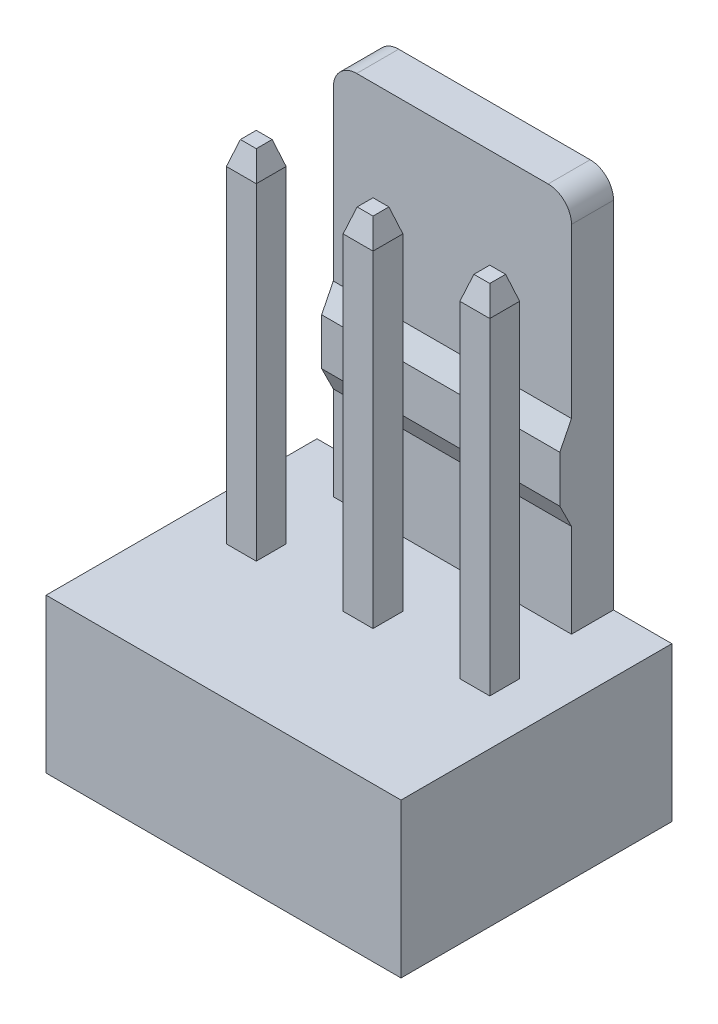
ISO-10303-21;
HEADER;
FILE_DESCRIPTION(('STEP AP214'),'2;1');
FILE_NAME('part.step','',(''),(''),'','','');
FILE_SCHEMA(('AUTOMOTIVE_DESIGN { 1 0 10303 214 1 1 1 1 }'));
ENDSEC;
DATA;
#1=APPLICATION_CONTEXT('core data for automotive mechanical design processes');
#2=APPLICATION_PROTOCOL_DEFINITION('international standard','automotive_design',2000,#1);
#3=PRODUCT_CONTEXT('',#1,'mechanical');
#4=PRODUCT('Part','Part','',(#3));
#5=PRODUCT_RELATED_PRODUCT_CATEGORY('part','',(#4));
#6=PRODUCT_DEFINITION_FORMATION('','',#4);
#7=PRODUCT_DEFINITION_CONTEXT('part definition',#1,'design');
#8=PRODUCT_DEFINITION('design','',#6,#7);
#9=PRODUCT_DEFINITION_SHAPE('','',#8);
#10=(LENGTH_UNIT() NAMED_UNIT(*) SI_UNIT(.MILLI.,.METRE.));
#11=(NAMED_UNIT(*) PLANE_ANGLE_UNIT() SI_UNIT($,.RADIAN.));
#12=(NAMED_UNIT(*) SI_UNIT($,.STERADIAN.) SOLID_ANGLE_UNIT());
#13=UNCERTAINTY_MEASURE_WITH_UNIT(LENGTH_MEASURE(1.E-05),#10,'distance_accuracy_value','');
#14=(GEOMETRIC_REPRESENTATION_CONTEXT(3) GLOBAL_UNCERTAINTY_ASSIGNED_CONTEXT((#13)) GLOBAL_UNIT_ASSIGNED_CONTEXT((#10,
#11,#12)) REPRESENTATION_CONTEXT('',''));
#15=CARTESIAN_POINT('',(0.,0.,0.));
#16=DIRECTION('',(0.,0.,1.));
#17=DIRECTION('',(1.,0.,0.));
#18=AXIS2_PLACEMENT_3D('',#15,#16,#17);
#19=CARTESIAN_POINT('',(3.8,0.,3.2));
#20=DIRECTION('',(0.,1.,0.));
#21=DIRECTION('',(0.,0.,1.));
#22=AXIS2_PLACEMENT_3D('',#19,#20,#21);
#23=PLANE('',#22);
#24=DIRECTION('',(0.,0.,-1.));
#25=VECTOR('',#24,1.);
#26=CARTESIAN_POINT('',(0.32,0.,0.32));
#27=LINE('',#26,#25);
#28=CARTESIAN_POINT('',(0.32,0.,0.32));
#29=VERTEX_POINT('',#28);
#30=CARTESIAN_POINT('',(0.32,0.,-0.32));
#31=VERTEX_POINT('',#30);
#32=EDGE_CURVE('E339',#29,#31,#27,.T.);
#33=ORIENTED_EDGE('',*,*,#32,.T.);
#34=DIRECTION('',(-1.,0.,0.));
#35=VECTOR('',#34,1.);
#36=CARTESIAN_POINT('',(0.32,0.,-0.32));
#37=LINE('',#36,#35);
#38=CARTESIAN_POINT('',(-0.32,0.,-0.32));
#39=VERTEX_POINT('',#38);
#40=EDGE_CURVE('E343',#31,#39,#37,.T.);
#41=ORIENTED_EDGE('',*,*,#40,.T.);
#42=DIRECTION('',(0.,0.,1.));
#43=VECTOR('',#42,1.);
#44=CARTESIAN_POINT('',(-0.32,0.,0.32));
#45=LINE('',#44,#43);
#46=CARTESIAN_POINT('',(-0.32,0.,0.32));
#47=VERTEX_POINT('',#46);
#48=EDGE_CURVE('E362',#39,#47,#45,.T.);
#49=ORIENTED_EDGE('',*,*,#48,.T.);
#50=DIRECTION('',(1.,0.,0.));
#51=VECTOR('',#50,1.);
#52=CARTESIAN_POINT('',(0.32,0.,0.32));
#53=LINE('',#52,#51);
#54=EDGE_CURVE('E353',#47,#29,#53,.T.);
#55=ORIENTED_EDGE('',*,*,#54,.T.);
#56=EDGE_LOOP('',(#33,#41,#49,#55));
#57=FACE_BOUND('',#56,.T.);
#58=DIRECTION('',(0.,0.,-1.));
#59=VECTOR('',#58,1.);
#60=CARTESIAN_POINT('',(-3.8,0.,3.2));
#61=LINE('',#60,#59);
#62=CARTESIAN_POINT('',(-3.8,0.,3.2));
#63=VERTEX_POINT('',#62);
#64=CARTESIAN_POINT('',(-3.8,0.,-2.6));
#65=VERTEX_POINT('',#64);
#66=EDGE_CURVE('E515',#63,#65,#61,.T.);
#67=ORIENTED_EDGE('',*,*,#66,.T.);
#68=DIRECTION('',(-1.,0.,0.));
#69=VECTOR('',#68,1.);
#70=CARTESIAN_POINT('',(3.8,0.,-2.6));
#71=LINE('',#70,#69);
#72=CARTESIAN_POINT('',(3.8,0.,-2.6));
#73=VERTEX_POINT('',#72);
#74=EDGE_CURVE('E540',#73,#65,#71,.T.);
#75=ORIENTED_EDGE('',*,*,#74,.F.);
#76=DIRECTION('',(0.,0.,-1.));
#77=VECTOR('',#76,1.);
#78=CARTESIAN_POINT('',(3.8,0.,3.2));
#79=LINE('',#78,#77);
#80=CARTESIAN_POINT('',(3.8,0.,3.2));
#81=VERTEX_POINT('',#80);
#82=EDGE_CURVE('E504',#81,#73,#79,.T.);
#83=ORIENTED_EDGE('',*,*,#82,.F.);
#84=DIRECTION('',(-1.,0.,0.));
#85=VECTOR('',#84,1.);
#86=CARTESIAN_POINT('',(3.8,0.,3.2));
#87=LINE('',#86,#85);
#88=EDGE_CURVE('E543',#81,#63,#87,.T.);
#89=ORIENTED_EDGE('',*,*,#88,.T.);
#90=EDGE_LOOP('',(#67,#75,#83,#89));
#91=FACE_BOUND('',#90,.T.);
#92=DIRECTION('',(0.,0.,1.));
#93=VECTOR('',#92,1.);
#94=CARTESIAN_POINT('',(-2.82,0.,0.320000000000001));
#95=LINE('',#94,#93);
#96=CARTESIAN_POINT('',(-2.82,0.,-0.319999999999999));
#97=VERTEX_POINT('',#96);
#98=CARTESIAN_POINT('',(-2.82,0.,0.320000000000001));
#99=VERTEX_POINT('',#98);
#100=EDGE_CURVE('E376',#97,#99,#95,.T.);
#101=ORIENTED_EDGE('',*,*,#100,.T.);
#102=DIRECTION('',(1.,0.,0.));
#103=VECTOR('',#102,1.);
#104=CARTESIAN_POINT('',(-2.82,0.,0.320000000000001));
#105=LINE('',#104,#103);
#106=CARTESIAN_POINT('',(-2.18,0.,0.32));
#107=VERTEX_POINT('',#106);
#108=EDGE_CURVE('E390',#99,#107,#105,.T.);
#109=ORIENTED_EDGE('',*,*,#108,.T.);
#110=DIRECTION('',(0.,0.,-1.));
#111=VECTOR('',#110,1.);
#112=CARTESIAN_POINT('',(-2.18,0.,0.32));
#113=LINE('',#112,#111);
#114=CARTESIAN_POINT('',(-2.18,0.,-0.32));
#115=VERTEX_POINT('',#114);
#116=EDGE_CURVE('E393',#107,#115,#113,.T.);
#117=ORIENTED_EDGE('',*,*,#116,.T.);
#118=DIRECTION('',(-1.,0.,0.));
#119=VECTOR('',#118,1.);
#120=CARTESIAN_POINT('',(-2.82,0.,-0.32));
#121=LINE('',#120,#119);
#122=EDGE_CURVE('E381',#115,#97,#121,.T.);
#123=ORIENTED_EDGE('',*,*,#122,.T.);
#124=EDGE_LOOP('',(#101,#109,#117,#123));
#125=FACE_BOUND('',#124,.T.);
#126=DIRECTION('',(0.,0.,1.));
#127=VECTOR('',#126,1.);
#128=CARTESIAN_POINT('',(2.18,0.,0.32));
#129=LINE('',#128,#127);
#130=CARTESIAN_POINT('',(2.18,0.,-0.32));
#131=VERTEX_POINT('',#130);
#132=CARTESIAN_POINT('',(2.18,0.,0.32));
#133=VERTEX_POINT('',#132);
#134=EDGE_CURVE('E637',#131,#133,#129,.T.);
#135=ORIENTED_EDGE('',*,*,#134,.T.);
#136=DIRECTION('',(1.,0.,0.));
#137=VECTOR('',#136,1.);
#138=CARTESIAN_POINT('',(2.18,0.,0.32));
#139=LINE('',#138,#137);
#140=CARTESIAN_POINT('',(2.82,0.,0.32));
#141=VERTEX_POINT('',#140);
#142=EDGE_CURVE('E338',#133,#141,#139,.T.);
#143=ORIENTED_EDGE('',*,*,#142,.T.);
#144=DIRECTION('',(0.,0.,-1.));
#145=VECTOR('',#144,1.);
#146=CARTESIAN_POINT('',(2.82,0.,0.32));
#147=LINE('',#146,#145);
#148=CARTESIAN_POINT('',(2.82,0.,-0.32));
#149=VERTEX_POINT('',#148);
#150=EDGE_CURVE('E1280',#141,#149,#147,.T.);
#151=ORIENTED_EDGE('',*,*,#150,.T.);
#152=DIRECTION('',(-1.,0.,0.));
#153=VECTOR('',#152,1.);
#154=CARTESIAN_POINT('',(2.18,0.,-0.32));
#155=LINE('',#154,#153);
#156=EDGE_CURVE('E334',#149,#131,#155,.T.);
#157=ORIENTED_EDGE('',*,*,#156,.T.);
#158=EDGE_LOOP('',(#135,#143,#151,#157));
#159=FACE_BOUND('',#158,.T.);
#160=ADVANCED_FACE('F34',(#57,#91,#125,#159),#23,.F.);
#161=CARTESIAN_POINT('',(3.8,3.3,3.2));
#162=DIRECTION('',(0.,-1.,0.));
#163=DIRECTION('',(0.,0.,-1.));
#164=AXIS2_PLACEMENT_3D('',#161,#162,#163);
#165=PLANE('',#164);
#166=DIRECTION('',(0.,0.,-1.));
#167=VECTOR('',#166,1.);
#168=CARTESIAN_POINT('',(0.320000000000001,3.3,3.2));
#169=LINE('',#168,#167);
#170=CARTESIAN_POINT('',(0.32,3.3,0.32));
#171=VERTEX_POINT('',#170);
#172=CARTESIAN_POINT('',(0.32,3.3,-0.32));
#173=VERTEX_POINT('',#172);
#174=EDGE_CURVE('E444',#171,#173,#169,.T.);
#175=ORIENTED_EDGE('',*,*,#174,.F.);
#176=DIRECTION('',(1.,0.,0.));
#177=VECTOR('',#176,1.);
#178=CARTESIAN_POINT('',(3.8,3.3,0.32));
#179=LINE('',#178,#177);
#180=CARTESIAN_POINT('',(-0.32,3.3,0.32));
#181=VERTEX_POINT('',#180);
#182=EDGE_CURVE('E435',#181,#171,#179,.T.);
#183=ORIENTED_EDGE('',*,*,#182,.F.);
#184=DIRECTION('',(0.,0.,1.));
#185=VECTOR('',#184,1.);
#186=CARTESIAN_POINT('',(-0.32,3.3,3.2));
#187=LINE('',#186,#185);
#188=CARTESIAN_POINT('',(-0.319999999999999,3.3,-0.32));
#189=VERTEX_POINT('',#188);
#190=EDGE_CURVE('E438',#189,#181,#187,.T.);
#191=ORIENTED_EDGE('',*,*,#190,.F.);
#192=DIRECTION('',(-1.,0.,0.));
#193=VECTOR('',#192,1.);
#194=CARTESIAN_POINT('',(3.8,3.3,-0.32));
#195=LINE('',#194,#193);
#196=EDGE_CURVE('E441',#173,#189,#195,.T.);
#197=ORIENTED_EDGE('',*,*,#196,.F.);
#198=EDGE_LOOP('',(#175,#183,#191,#197));
#199=FACE_BOUND('',#198,.T.);
#200=DIRECTION('',(0.,0.,1.));
#201=VECTOR('',#200,1.);
#202=CARTESIAN_POINT('',(-3.8,3.3,3.2));
#203=LINE('',#202,#201);
#204=CARTESIAN_POINT('',(-3.8,3.3,-2.6));
#205=VERTEX_POINT('',#204);
#206=CARTESIAN_POINT('',(-3.8,3.3,3.2));
#207=VERTEX_POINT('',#206);
#208=EDGE_CURVE('E505',#205,#207,#203,.T.);
#209=ORIENTED_EDGE('',*,*,#208,.T.);
#210=DIRECTION('',(-1.,0.,0.));
#211=VECTOR('',#210,1.);
#212=CARTESIAN_POINT('',(3.8,3.3,3.2));
#213=LINE('',#212,#211);
#214=CARTESIAN_POINT('',(3.8,3.3,3.2));
#215=VERTEX_POINT('',#214);
#216=EDGE_CURVE('E512',#215,#207,#213,.T.);
#217=ORIENTED_EDGE('',*,*,#216,.F.);
#218=DIRECTION('',(0.,0.,1.));
#219=VECTOR('',#218,1.);
#220=CARTESIAN_POINT('',(3.8,3.3,3.2));
#221=LINE('',#220,#219);
#222=CARTESIAN_POINT('',(3.8,3.3,-2.6));
#223=VERTEX_POINT('',#222);
#224=EDGE_CURVE('E510',#223,#215,#221,.T.);
#225=ORIENTED_EDGE('',*,*,#224,.F.);
#226=DIRECTION('',(-1.,0.,0.));
#227=VECTOR('',#226,1.);
#228=CARTESIAN_POINT('',(2.55,3.30000000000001,-2.6));
#229=LINE('',#228,#227);
#230=CARTESIAN_POINT('',(2.55,3.30000000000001,-2.6));
#231=VERTEX_POINT('',#230);
#232=EDGE_CURVE('E455',#223,#231,#229,.T.);
#233=ORIENTED_EDGE('',*,*,#232,.T.);
#234=DIRECTION('',(0.,0.,-1.));
#235=VECTOR('',#234,1.);
#236=CARTESIAN_POINT('',(2.55,3.30000000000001,3.2));
#237=LINE('',#236,#235);
#238=CARTESIAN_POINT('',(2.55,3.30000000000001,-1.7));
#239=VERTEX_POINT('',#238);
#240=EDGE_CURVE('E461',#239,#231,#237,.T.);
#241=ORIENTED_EDGE('',*,*,#240,.F.);
#242=DIRECTION('',(-1.,0.,0.));
#243=VECTOR('',#242,1.);
#244=CARTESIAN_POINT('',(3.8,3.3,-1.7));
#245=LINE('',#244,#243);
#246=CARTESIAN_POINT('',(-2.55,3.3,-1.7));
#247=VERTEX_POINT('',#246);
#248=EDGE_CURVE('E523',#239,#247,#245,.T.);
#249=ORIENTED_EDGE('',*,*,#248,.T.);
#250=DIRECTION('',(0.,0.,-1.));
#251=VECTOR('',#250,1.);
#252=CARTESIAN_POINT('',(-2.55,3.3,3.2));
#253=LINE('',#252,#251);
#254=CARTESIAN_POINT('',(-2.55,3.3,-2.6));
#255=VERTEX_POINT('',#254);
#256=EDGE_CURVE('E483',#247,#255,#253,.T.);
#257=ORIENTED_EDGE('',*,*,#256,.T.);
#258=DIRECTION('',(-1.,0.,0.));
#259=VECTOR('',#258,1.);
#260=CARTESIAN_POINT('',(-2.55,3.3,-2.6));
#261=LINE('',#260,#259);
#262=EDGE_CURVE('E480',#255,#205,#261,.T.);
#263=ORIENTED_EDGE('',*,*,#262,.T.);
#264=EDGE_LOOP('',(#209,#217,#225,#233,#241,#249,#257,#263));
#265=FACE_BOUND('',#264,.T.);
#266=DIRECTION('',(0.,0.,1.));
#267=VECTOR('',#266,1.);
#268=CARTESIAN_POINT('',(-2.82,3.3,3.2));
#269=LINE('',#268,#267);
#270=CARTESIAN_POINT('',(-2.82,3.3,-0.32));
#271=VERTEX_POINT('',#270);
#272=CARTESIAN_POINT('',(-2.82,3.3,0.320000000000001));
#273=VERTEX_POINT('',#272);
#274=EDGE_CURVE('E573',#271,#273,#269,.T.);
#275=ORIENTED_EDGE('',*,*,#274,.F.);
#276=DIRECTION('',(-1.,0.,0.));
#277=VECTOR('',#276,1.);
#278=CARTESIAN_POINT('',(3.8,3.3,-0.32));
#279=LINE('',#278,#277);
#280=CARTESIAN_POINT('',(-2.18,3.3,-0.32));
#281=VERTEX_POINT('',#280);
#282=EDGE_CURVE('E564',#281,#271,#279,.T.);
#283=ORIENTED_EDGE('',*,*,#282,.F.);
#284=DIRECTION('',(0.,0.,-1.));
#285=VECTOR('',#284,1.);
#286=CARTESIAN_POINT('',(-2.18,3.3,3.2));
#287=LINE('',#286,#285);
#288=CARTESIAN_POINT('',(-2.18,3.3,0.32));
#289=VERTEX_POINT('',#288);
#290=EDGE_CURVE('E567',#289,#281,#287,.T.);
#291=ORIENTED_EDGE('',*,*,#290,.F.);
#292=DIRECTION('',(1.,0.,0.));
#293=VECTOR('',#292,1.);
#294=CARTESIAN_POINT('',(3.8,3.3,0.319999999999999));
#295=LINE('',#294,#293);
#296=EDGE_CURVE('E570',#273,#289,#295,.T.);
#297=ORIENTED_EDGE('',*,*,#296,.F.);
#298=EDGE_LOOP('',(#275,#283,#291,#297));
#299=FACE_BOUND('',#298,.T.);
#300=DIRECTION('',(0.,0.,1.));
#301=VECTOR('',#300,1.);
#302=CARTESIAN_POINT('',(2.18,3.3,3.2));
#303=LINE('',#302,#301);
#304=CARTESIAN_POINT('',(2.18,3.3,-0.32));
#305=VERTEX_POINT('',#304);
#306=CARTESIAN_POINT('',(2.18,3.3,0.32));
#307=VERTEX_POINT('',#306);
#308=EDGE_CURVE('E424',#305,#307,#303,.T.);
#309=ORIENTED_EDGE('',*,*,#308,.F.);
#310=DIRECTION('',(-1.,0.,0.));
#311=VECTOR('',#310,1.);
#312=CARTESIAN_POINT('',(3.8,3.3,-0.32));
#313=LINE('',#312,#311);
#314=CARTESIAN_POINT('',(2.82,3.3,-0.32));
#315=VERTEX_POINT('',#314);
#316=EDGE_CURVE('E415',#315,#305,#313,.T.);
#317=ORIENTED_EDGE('',*,*,#316,.F.);
#318=DIRECTION('',(0.,0.,-1.));
#319=VECTOR('',#318,1.);
#320=CARTESIAN_POINT('',(2.82,3.3,3.2));
#321=LINE('',#320,#319);
#322=CARTESIAN_POINT('',(2.82,3.3,0.319999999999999));
#323=VERTEX_POINT('',#322);
#324=EDGE_CURVE('E418',#323,#315,#321,.T.);
#325=ORIENTED_EDGE('',*,*,#324,.F.);
#326=DIRECTION('',(1.,0.,0.));
#327=VECTOR('',#326,1.);
#328=CARTESIAN_POINT('',(3.8,3.3,0.32));
#329=LINE('',#328,#327);
#330=EDGE_CURVE('E421',#307,#323,#329,.T.);
#331=ORIENTED_EDGE('',*,*,#330,.F.);
#332=EDGE_LOOP('',(#309,#317,#325,#331));
#333=FACE_BOUND('',#332,.T.);
#334=ADVANCED_FACE('F692',(#199,#265,#299,#333),#165,.F.);
#335=CARTESIAN_POINT('',(3.8,0.,3.2));
#336=DIRECTION('',(0.,0.,-1.));
#337=DIRECTION('',(-1.,0.,0.));
#338=AXIS2_PLACEMENT_3D('',#335,#336,#337);
#339=PLANE('',#338);
#340=DIRECTION('',(0.,-1.,0.));
#341=VECTOR('',#340,1.);
#342=CARTESIAN_POINT('',(-3.8,0.,3.2));
#343=LINE('',#342,#341);
#344=EDGE_CURVE('E500',#207,#63,#343,.T.);
#345=ORIENTED_EDGE('',*,*,#344,.T.);
#346=ORIENTED_EDGE('',*,*,#88,.F.);
#347=DIRECTION('',(0.,-1.,0.));
#348=VECTOR('',#347,1.);
#349=CARTESIAN_POINT('',(3.8,0.,3.2));
#350=LINE('',#349,#348);
#351=EDGE_CURVE('E501',#215,#81,#350,.T.);
#352=ORIENTED_EDGE('',*,*,#351,.F.);
#353=ORIENTED_EDGE('',*,*,#216,.T.);
#354=EDGE_LOOP('',(#345,#346,#352,#353));
#355=FACE_BOUND('',#354,.T.);
#356=ADVANCED_FACE('F698',(#355),#339,.F.);
#357=CARTESIAN_POINT('',(3.8,0.,-2.6));
#358=DIRECTION('',(0.,0.,1.));
#359=DIRECTION('',(1.,0.,0.));
#360=AXIS2_PLACEMENT_3D('',#357,#358,#359);
#361=PLANE('',#360);
#362=DIRECTION('',(0.,-1.,0.));
#363=VECTOR('',#362,1.);
#364=CARTESIAN_POINT('',(-2.55,11.4,-2.6));
#365=LINE('',#364,#363);
#366=CARTESIAN_POINT('',(-2.55,10.9,-2.6));
#367=VERTEX_POINT('',#366);
#368=EDGE_CURVE('E478',#367,#255,#365,.T.);
#369=ORIENTED_EDGE('',*,*,#368,.F.);
#370=CARTESIAN_POINT('',(-2.05,10.9,-2.6));
#371=DIRECTION('',(0.,0.,1.));
#372=DIRECTION('',(1.,0.,0.));
#373=AXIS2_PLACEMENT_3D('',#370,#371,#372);
#374=CIRCLE('',#373,0.5);
#375=CARTESIAN_POINT('',(-2.05,11.4,-2.6));
#376=VERTEX_POINT('',#375);
#377=EDGE_CURVE('E551',#367,#376,#374,.F.);
#378=ORIENTED_EDGE('',*,*,#377,.T.);
#379=DIRECTION('',(-1.,0.,0.));
#380=VECTOR('',#379,1.);
#381=CARTESIAN_POINT('',(3.8,11.4,-2.6));
#382=LINE('',#381,#380);
#383=CARTESIAN_POINT('',(2.05,11.4,-2.6));
#384=VERTEX_POINT('',#383);
#385=EDGE_CURVE('E537',#384,#376,#382,.T.);
#386=ORIENTED_EDGE('',*,*,#385,.F.);
#387=CARTESIAN_POINT('',(2.05,10.9,-2.6));
#388=DIRECTION('',(0.,0.,1.));
#389=DIRECTION('',(1.,0.,0.));
#390=AXIS2_PLACEMENT_3D('',#387,#388,#389);
#391=CIRCLE('',#390,0.5);
#392=CARTESIAN_POINT('',(2.55,10.9,-2.6));
#393=VERTEX_POINT('',#392);
#394=EDGE_CURVE('E549',#384,#393,#391,.F.);
#395=ORIENTED_EDGE('',*,*,#394,.T.);
#396=DIRECTION('',(0.,1.,0.));
#397=VECTOR('',#396,1.);
#398=CARTESIAN_POINT('',(2.55,11.4,-2.6));
#399=LINE('',#398,#397);
#400=EDGE_CURVE('E458',#231,#393,#399,.T.);
#401=ORIENTED_EDGE('',*,*,#400,.F.);
#402=ORIENTED_EDGE('',*,*,#232,.F.);
#403=DIRECTION('',(0.,1.,0.));
#404=VECTOR('',#403,1.);
#405=CARTESIAN_POINT('',(3.8,0.,-2.6));
#406=LINE('',#405,#404);
#407=EDGE_CURVE('E507',#73,#223,#406,.T.);
#408=ORIENTED_EDGE('',*,*,#407,.F.);
#409=ORIENTED_EDGE('',*,*,#74,.T.);
#410=DIRECTION('',(0.,1.,0.));
#411=VECTOR('',#410,1.);
#412=CARTESIAN_POINT('',(-3.8,0.,-2.6));
#413=LINE('',#412,#411);
#414=EDGE_CURVE('E517',#65,#205,#413,.T.);
#415=ORIENTED_EDGE('',*,*,#414,.T.);
#416=ORIENTED_EDGE('',*,*,#262,.F.);
#417=EDGE_LOOP('',(#369,#378,#386,#395,#401,#402,#408,#409,#415,#416));
#418=FACE_BOUND('',#417,.T.);
#419=ADVANCED_FACE('F704',(#418),#361,.F.);
#420=CARTESIAN_POINT('',(3.8,11.4,-2.6));
#421=DIRECTION('',(0.,-1.,0.));
#422=DIRECTION('',(0.,0.,-1.));
#423=AXIS2_PLACEMENT_3D('',#420,#421,#422);
#424=PLANE('',#423);
#425=ORIENTED_EDGE('',*,*,#385,.T.);
#426=DIRECTION('',(0.,0.,-1.));
#427=VECTOR('',#426,1.);
#428=CARTESIAN_POINT('',(-2.05,11.4,-2.6));
#429=LINE('',#428,#427);
#430=CARTESIAN_POINT('',(-2.05,11.4,-1.7));
#431=VERTEX_POINT('',#430);
#432=EDGE_CURVE('E556',#376,#431,#429,.F.);
#433=ORIENTED_EDGE('',*,*,#432,.T.);
#434=DIRECTION('',(-1.,0.,0.));
#435=VECTOR('',#434,1.);
#436=CARTESIAN_POINT('',(3.8,11.4,-1.7));
#437=LINE('',#436,#435);
#438=CARTESIAN_POINT('',(2.05,11.4,-1.7));
#439=VERTEX_POINT('',#438);
#440=EDGE_CURVE('E534',#439,#431,#437,.T.);
#441=ORIENTED_EDGE('',*,*,#440,.F.);
#442=DIRECTION('',(0.,0.,-1.));
#443=VECTOR('',#442,1.);
#444=CARTESIAN_POINT('',(2.05,11.4,-2.6));
#445=LINE('',#444,#443);
#446=EDGE_CURVE('E553',#439,#384,#445,.T.);
#447=ORIENTED_EDGE('',*,*,#446,.T.);
#448=EDGE_LOOP('',(#425,#433,#441,#447));
#449=FACE_BOUND('',#448,.T.);
#450=ADVANCED_FACE('F1109',(#449),#424,.F.);
#451=CARTESIAN_POINT('',(3.8,11.4,-1.7));
#452=DIRECTION('',(0.,0.,-1.));
#453=DIRECTION('',(0.,1.,0.));
#454=AXIS2_PLACEMENT_3D('',#451,#452,#453);
#455=PLANE('',#454);
#456=ORIENTED_EDGE('',*,*,#440,.T.);
#457=CARTESIAN_POINT('',(-2.05,10.9,-1.7));
#458=DIRECTION('',(0.,0.,-1.));
#459=DIRECTION('',(0.,1.,0.));
#460=AXIS2_PLACEMENT_3D('',#457,#458,#459);
#461=CIRCLE('',#460,0.5);
#462=CARTESIAN_POINT('',(-2.55,10.9,-1.7));
#463=VERTEX_POINT('',#462);
#464=EDGE_CURVE('E560',#431,#463,#461,.F.);
#465=ORIENTED_EDGE('',*,*,#464,.T.);
#466=DIRECTION('',(0.,-1.,0.));
#467=VECTOR('',#466,1.);
#468=CARTESIAN_POINT('',(-2.55,11.4,-1.7));
#469=LINE('',#468,#467);
#470=CARTESIAN_POINT('',(-2.55,7.3,-1.7));
#471=VERTEX_POINT('',#470);
#472=EDGE_CURVE('E498',#463,#471,#469,.T.);
#473=ORIENTED_EDGE('',*,*,#472,.T.);
#474=DIRECTION('',(-1.,0.,0.));
#475=VECTOR('',#474,1.);
#476=CARTESIAN_POINT('',(3.8,7.3,-1.7));
#477=LINE('',#476,#475);
#478=CARTESIAN_POINT('',(2.55,7.3,-1.7));
#479=VERTEX_POINT('',#478);
#480=EDGE_CURVE('E531',#479,#471,#477,.T.);
#481=ORIENTED_EDGE('',*,*,#480,.F.);
#482=DIRECTION('',(0.,1.,0.));
#483=VECTOR('',#482,1.);
#484=CARTESIAN_POINT('',(2.55,11.4,-1.7));
#485=LINE('',#484,#483);
#486=CARTESIAN_POINT('',(2.55,10.9,-1.7));
#487=VERTEX_POINT('',#486);
#488=EDGE_CURVE('E475',#479,#487,#485,.T.);
#489=ORIENTED_EDGE('',*,*,#488,.T.);
#490=CARTESIAN_POINT('',(2.05,10.9,-1.7));
#491=DIRECTION('',(0.,0.,-1.));
#492=DIRECTION('',(0.,1.,0.));
#493=AXIS2_PLACEMENT_3D('',#490,#491,#492);
#494=CIRCLE('',#493,0.5);
#495=EDGE_CURVE('E558',#487,#439,#494,.F.);
#496=ORIENTED_EDGE('',*,*,#495,.T.);
#497=EDGE_LOOP('',(#456,#465,#473,#481,#489,#496));
#498=FACE_BOUND('',#497,.T.);
#499=ADVANCED_FACE('F1101',(#498),#455,.F.);
#500=CARTESIAN_POINT('',(3.8,7.3,-1.7));
#501=DIRECTION('',(0.,-0.44721359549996,-0.894427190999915));
#502=DIRECTION('',(0.,0.894427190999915,-0.44721359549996));
#503=AXIS2_PLACEMENT_3D('',#500,#501,#502);
#504=PLANE('',#503);
#505=DIRECTION('',(-1.,0.,0.));
#506=VECTOR('',#505,1.);
#507=CARTESIAN_POINT('',(3.8,6.8,-1.45));
#508=LINE('',#507,#506);
#509=CARTESIAN_POINT('',(2.55,6.8,-1.45));
#510=VERTEX_POINT('',#509);
#511=CARTESIAN_POINT('',(-2.55,6.8,-1.45));
#512=VERTEX_POINT('',#511);
#513=EDGE_CURVE('E529',#510,#512,#508,.T.);
#514=ORIENTED_EDGE('',*,*,#513,.F.);
#515=DIRECTION('',(0.,0.894427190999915,-0.44721359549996));
#516=VECTOR('',#515,1.);
#517=CARTESIAN_POINT('',(2.55,7.3,-1.7));
#518=LINE('',#517,#516);
#519=EDGE_CURVE('E472',#510,#479,#518,.T.);
#520=ORIENTED_EDGE('',*,*,#519,.T.);
#521=ORIENTED_EDGE('',*,*,#480,.T.);
#522=DIRECTION('',(0.,-0.894427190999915,0.44721359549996));
#523=VECTOR('',#522,1.);
#524=CARTESIAN_POINT('',(-2.55,7.3,-1.7));
#525=LINE('',#524,#523);
#526=EDGE_CURVE('E495',#471,#512,#525,.T.);
#527=ORIENTED_EDGE('',*,*,#526,.T.);
#528=EDGE_LOOP('',(#514,#520,#521,#527));
#529=FACE_BOUND('',#528,.T.);
#530=ADVANCED_FACE('F1093',(#529),#504,.F.);
#531=CARTESIAN_POINT('',(3.8,6.8,-1.45));
#532=DIRECTION('',(0.,0.,-1.));
#533=DIRECTION('',(-1.,0.,0.));
#534=AXIS2_PLACEMENT_3D('',#531,#532,#533);
#535=PLANE('',#534);
#536=DIRECTION('',(-1.,0.,0.));
#537=VECTOR('',#536,1.);
#538=CARTESIAN_POINT('',(3.8,5.8,-1.45));
#539=LINE('',#538,#537);
#540=CARTESIAN_POINT('',(2.55,5.8,-1.45));
#541=VERTEX_POINT('',#540);
#542=CARTESIAN_POINT('',(-2.55,5.8,-1.45));
#543=VERTEX_POINT('',#542);
#544=EDGE_CURVE('E527',#541,#543,#539,.T.);
#545=ORIENTED_EDGE('',*,*,#544,.F.);
#546=DIRECTION('',(0.,1.,0.));
#547=VECTOR('',#546,1.);
#548=CARTESIAN_POINT('',(2.55,6.8,-1.45));
#549=LINE('',#548,#547);
#550=EDGE_CURVE('E469',#541,#510,#549,.T.);
#551=ORIENTED_EDGE('',*,*,#550,.T.);
#552=ORIENTED_EDGE('',*,*,#513,.T.);
#553=DIRECTION('',(0.,-1.,0.));
#554=VECTOR('',#553,1.);
#555=CARTESIAN_POINT('',(-2.55,6.8,-1.45));
#556=LINE('',#555,#554);
#557=EDGE_CURVE('E492',#512,#543,#556,.T.);
#558=ORIENTED_EDGE('',*,*,#557,.T.);
#559=EDGE_LOOP('',(#545,#551,#552,#558));
#560=FACE_BOUND('',#559,.T.);
#561=ADVANCED_FACE('F1085',(#560),#535,.F.);
#562=CARTESIAN_POINT('',(3.8,5.8,-1.45));
#563=DIRECTION('',(0.,0.44721359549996,-0.894427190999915));
#564=DIRECTION('',(0.,0.894427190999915,0.44721359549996));
#565=AXIS2_PLACEMENT_3D('',#562,#563,#564);
#566=PLANE('',#565);
#567=DIRECTION('',(-1.,0.,0.));
#568=VECTOR('',#567,1.);
#569=CARTESIAN_POINT('',(3.8,5.3,-1.7));
#570=LINE('',#569,#568);
#571=CARTESIAN_POINT('',(2.55,5.3,-1.7));
#572=VERTEX_POINT('',#571);
#573=CARTESIAN_POINT('',(-2.55,5.3,-1.7));
#574=VERTEX_POINT('',#573);
#575=EDGE_CURVE('E525',#572,#574,#570,.T.);
#576=ORIENTED_EDGE('',*,*,#575,.F.);
#577=DIRECTION('',(0.,0.894427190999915,0.44721359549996));
#578=VECTOR('',#577,1.);
#579=CARTESIAN_POINT('',(2.55,5.8,-1.45));
#580=LINE('',#579,#578);
#581=EDGE_CURVE('E466',#572,#541,#580,.T.);
#582=ORIENTED_EDGE('',*,*,#581,.T.);
#583=ORIENTED_EDGE('',*,*,#544,.T.);
#584=DIRECTION('',(0.,-0.894427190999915,-0.44721359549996));
#585=VECTOR('',#584,1.);
#586=CARTESIAN_POINT('',(-2.55,5.8,-1.45));
#587=LINE('',#586,#585);
#588=EDGE_CURVE('E489',#543,#574,#587,.T.);
#589=ORIENTED_EDGE('',*,*,#588,.T.);
#590=EDGE_LOOP('',(#576,#582,#583,#589));
#591=FACE_BOUND('',#590,.T.);
#592=ADVANCED_FACE('F1077',(#591),#566,.F.);
#593=CARTESIAN_POINT('',(3.8,5.3,-1.7));
#594=DIRECTION('',(0.,0.,-1.));
#595=DIRECTION('',(0.,1.,0.));
#596=AXIS2_PLACEMENT_3D('',#593,#594,#595);
#597=PLANE('',#596);
#598=ORIENTED_EDGE('',*,*,#248,.F.);
#599=DIRECTION('',(0.,1.,0.));
#600=VECTOR('',#599,1.);
#601=CARTESIAN_POINT('',(2.55,5.3,-1.7));
#602=LINE('',#601,#600);
#603=EDGE_CURVE('E463',#239,#572,#602,.T.);
#604=ORIENTED_EDGE('',*,*,#603,.T.);
#605=ORIENTED_EDGE('',*,*,#575,.T.);
#606=DIRECTION('',(0.,-1.,0.));
#607=VECTOR('',#606,1.);
#608=CARTESIAN_POINT('',(-2.55,5.3,-1.7));
#609=LINE('',#608,#607);
#610=EDGE_CURVE('E486',#574,#247,#609,.T.);
#611=ORIENTED_EDGE('',*,*,#610,.T.);
#612=EDGE_LOOP('',(#598,#604,#605,#611));
#613=FACE_BOUND('',#612,.T.);
#614=ADVANCED_FACE('F1069',(#613),#597,.F.);
#615=CARTESIAN_POINT('',(3.8,3.3,3.2));
#616=DIRECTION('',(-1.,0.,0.));
#617=DIRECTION('',(0.,0.,1.));
#618=AXIS2_PLACEMENT_3D('',#615,#616,#617);
#619=PLANE('',#618);
#620=ORIENTED_EDGE('',*,*,#407,.T.);
#621=ORIENTED_EDGE('',*,*,#224,.T.);
#622=ORIENTED_EDGE('',*,*,#351,.T.);
#623=ORIENTED_EDGE('',*,*,#82,.T.);
#624=EDGE_LOOP('',(#620,#621,#622,#623));
#625=FACE_BOUND('',#624,.T.);
#626=ADVANCED_FACE('F1060',(#625),#619,.F.);
#627=CARTESIAN_POINT('',(-3.8,3.3,3.2));
#628=DIRECTION('',(-1.,0.,0.));
#629=DIRECTION('',(0.,0.,1.));
#630=AXIS2_PLACEMENT_3D('',#627,#628,#629);
#631=PLANE('',#630);
#632=ORIENTED_EDGE('',*,*,#208,.F.);
#633=ORIENTED_EDGE('',*,*,#414,.F.);
#634=ORIENTED_EDGE('',*,*,#66,.F.);
#635=ORIENTED_EDGE('',*,*,#344,.F.);
#636=EDGE_LOOP('',(#632,#633,#634,#635));
#637=FACE_BOUND('',#636,.T.);
#638=ADVANCED_FACE('F1051',(#637),#631,.T.);
#639=CARTESIAN_POINT('',(-2.55,11.4,3.2));
#640=DIRECTION('',(1.,0.,0.));
#641=DIRECTION('',(0.,1.,0.));
#642=AXIS2_PLACEMENT_3D('',#639,#640,#641);
#643=PLANE('',#642);
#644=ORIENTED_EDGE('',*,*,#472,.F.);
#645=DIRECTION('',(0.,0.,-1.));
#646=VECTOR('',#645,1.);
#647=CARTESIAN_POINT('',(-2.55,10.9,3.2));
#648=LINE('',#647,#646);
#649=EDGE_CURVE('E546',#463,#367,#648,.T.);
#650=ORIENTED_EDGE('',*,*,#649,.T.);
#651=ORIENTED_EDGE('',*,*,#368,.T.);
#652=ORIENTED_EDGE('',*,*,#256,.F.);
#653=ORIENTED_EDGE('',*,*,#610,.F.);
#654=ORIENTED_EDGE('',*,*,#588,.F.);
#655=ORIENTED_EDGE('',*,*,#557,.F.);
#656=ORIENTED_EDGE('',*,*,#526,.F.);
#657=EDGE_LOOP('',(#644,#650,#651,#652,#653,#654,#655,#656));
#658=FACE_BOUND('',#657,.T.);
#659=ADVANCED_FACE('F1043',(#658),#643,.F.);
#660=CARTESIAN_POINT('',(2.55,11.4,3.2));
#661=DIRECTION('',(-1.,0.,0.));
#662=DIRECTION('',(0.,-1.,0.));
#663=AXIS2_PLACEMENT_3D('',#660,#661,#662);
#664=PLANE('',#663);
#665=ORIENTED_EDGE('',*,*,#400,.T.);
#666=DIRECTION('',(0.,0.,-1.));
#667=VECTOR('',#666,1.);
#668=CARTESIAN_POINT('',(2.55,10.9,3.2));
#669=LINE('',#668,#667);
#670=EDGE_CURVE('E562',#393,#487,#669,.F.);
#671=ORIENTED_EDGE('',*,*,#670,.T.);
#672=ORIENTED_EDGE('',*,*,#488,.F.);
#673=ORIENTED_EDGE('',*,*,#519,.F.);
#674=ORIENTED_EDGE('',*,*,#550,.F.);
#675=ORIENTED_EDGE('',*,*,#581,.F.);
#676=ORIENTED_EDGE('',*,*,#603,.F.);
#677=ORIENTED_EDGE('',*,*,#240,.T.);
#678=EDGE_LOOP('',(#665,#671,#672,#673,#674,#675,#676,#677));
#679=FACE_BOUND('',#678,.T.);
#680=ADVANCED_FACE('F713',(#679),#664,.F.);
#681=CARTESIAN_POINT('',(-2.05,10.9,3.2));
#682=DIRECTION('',(0.,0.,-1.));
#683=DIRECTION('',(-1.,0.,0.));
#684=AXIS2_PLACEMENT_3D('',#681,#682,#683);
#685=CYLINDRICAL_SURFACE('',#684,0.5);
#686=ORIENTED_EDGE('',*,*,#464,.F.);
#687=ORIENTED_EDGE('',*,*,#432,.F.);
#688=ORIENTED_EDGE('',*,*,#377,.F.);
#689=ORIENTED_EDGE('',*,*,#649,.F.);
#690=EDGE_LOOP('',(#686,#687,#688,#689));
#691=FACE_BOUND('',#690,.T.);
#692=ADVANCED_FACE('F709',(#691),#685,.T.);
#693=CARTESIAN_POINT('',(2.05,10.9,-2.6));
#694=DIRECTION('',(0.,0.,-1.));
#695=DIRECTION('',(-1.,0.,0.));
#696=AXIS2_PLACEMENT_3D('',#693,#694,#695);
#697=CYLINDRICAL_SURFACE('',#696,0.5);
#698=ORIENTED_EDGE('',*,*,#495,.F.);
#699=ORIENTED_EDGE('',*,*,#670,.F.);
#700=ORIENTED_EDGE('',*,*,#394,.F.);
#701=ORIENTED_EDGE('',*,*,#446,.F.);
#702=EDGE_LOOP('',(#698,#699,#700,#701));
#703=FACE_BOUND('',#702,.T.);
#704=ADVANCED_FACE('F712',(#703),#697,.T.);
#705=CARTESIAN_POINT('',(-2.82,10.8,0.320000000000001));
#706=DIRECTION('',(1.,0.,0.));
#707=DIRECTION('',(0.,0.,-1.));
#708=AXIS2_PLACEMENT_3D('',#705,#706,#707);
#709=PLANE('',#708);
#710=DIRECTION('',(0.,-1.,0.));
#711=VECTOR('',#710,1.);
#712=CARTESIAN_POINT('',(-2.82,10.8,0.320000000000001));
#713=LINE('',#712,#711);
#714=CARTESIAN_POINT('',(-2.82,10.3,0.320000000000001));
#715=VERTEX_POINT('',#714);
#716=EDGE_CURVE('E453',#715,#273,#713,.T.);
#717=ORIENTED_EDGE('',*,*,#716,.F.);
#718=DIRECTION('',(0.,0.,-1.));
#719=VECTOR('',#718,1.);
#720=CARTESIAN_POINT('',(-2.82,10.3,0.320000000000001));
#721=LINE('',#720,#719);
#722=CARTESIAN_POINT('',(-2.82,10.3,-0.32));
#723=VERTEX_POINT('',#722);
#724=EDGE_CURVE('E592',#715,#723,#721,.T.);
#725=ORIENTED_EDGE('',*,*,#724,.T.);
#726=DIRECTION('',(0.,-1.,0.));
#727=VECTOR('',#726,1.);
#728=CARTESIAN_POINT('',(-2.82,10.8,-0.32));
#729=LINE('',#728,#727);
#730=EDGE_CURVE('E447',#723,#271,#729,.T.);
#731=ORIENTED_EDGE('',*,*,#730,.T.);
#732=ORIENTED_EDGE('',*,*,#274,.T.);
#733=EDGE_LOOP('',(#717,#725,#731,#732));
#734=FACE_BOUND('',#733,.T.);
#735=ADVANCED_FACE('F717',(#734),#709,.F.);
#736=CARTESIAN_POINT('',(-2.82,10.8,0.320000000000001));
#737=DIRECTION('',(0.,0.,-1.));
#738=DIRECTION('',(-1.,0.,0.));
#739=AXIS2_PLACEMENT_3D('',#736,#737,#738);
#740=PLANE('',#739);
#741=DIRECTION('',(0.,-1.,0.));
#742=VECTOR('',#741,1.);
#743=CARTESIAN_POINT('',(-2.18,10.8,0.32));
#744=LINE('',#743,#742);
#745=CARTESIAN_POINT('',(-2.18,10.3,0.32));
#746=VERTEX_POINT('',#745);
#747=EDGE_CURVE('E451',#746,#289,#744,.T.);
#748=ORIENTED_EDGE('',*,*,#747,.F.);
#749=DIRECTION('',(-1.,0.,0.));
#750=VECTOR('',#749,1.);
#751=CARTESIAN_POINT('',(-2.82,10.3,0.320000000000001));
#752=LINE('',#751,#750);
#753=EDGE_CURVE('E590',#746,#715,#752,.T.);
#754=ORIENTED_EDGE('',*,*,#753,.T.);
#755=ORIENTED_EDGE('',*,*,#716,.T.);
#756=ORIENTED_EDGE('',*,*,#296,.T.);
#757=EDGE_LOOP('',(#748,#754,#755,#756));
#758=FACE_BOUND('',#757,.T.);
#759=ADVANCED_FACE('F1007',(#758),#740,.F.);
#760=CARTESIAN_POINT('',(-2.18,10.8,0.32));
#761=DIRECTION('',(-1.,0.,0.));
#762=DIRECTION('',(0.,0.,1.));
#763=AXIS2_PLACEMENT_3D('',#760,#761,#762);
#764=PLANE('',#763);
#765=DIRECTION('',(0.,-1.,0.));
#766=VECTOR('',#765,1.);
#767=CARTESIAN_POINT('',(-2.18,10.8,-0.32));
#768=LINE('',#767,#766);
#769=CARTESIAN_POINT('',(-2.18,10.3,-0.32));
#770=VERTEX_POINT('',#769);
#771=EDGE_CURVE('E449',#770,#281,#768,.T.);
#772=ORIENTED_EDGE('',*,*,#771,.F.);
#773=DIRECTION('',(0.,0.,1.));
#774=VECTOR('',#773,1.);
#775=CARTESIAN_POINT('',(-2.18,10.3,0.32));
#776=LINE('',#775,#774);
#777=EDGE_CURVE('E588',#770,#746,#776,.T.);
#778=ORIENTED_EDGE('',*,*,#777,.T.);
#779=ORIENTED_EDGE('',*,*,#747,.T.);
#780=ORIENTED_EDGE('',*,*,#290,.T.);
#781=EDGE_LOOP('',(#772,#778,#779,#780));
#782=FACE_BOUND('',#781,.T.);
#783=ADVANCED_FACE('F997',(#782),#764,.F.);
#784=CARTESIAN_POINT('',(-2.82,10.8,-0.32));
#785=DIRECTION('',(0.,0.,1.));
#786=DIRECTION('',(1.,0.,0.));
#787=AXIS2_PLACEMENT_3D('',#784,#785,#786);
#788=PLANE('',#787);
#789=ORIENTED_EDGE('',*,*,#730,.F.);
#790=DIRECTION('',(1.,0.,0.));
#791=VECTOR('',#790,1.);
#792=CARTESIAN_POINT('',(-2.82,10.3,-0.32));
#793=LINE('',#792,#791);
#794=EDGE_CURVE('E585',#723,#770,#793,.T.);
#795=ORIENTED_EDGE('',*,*,#794,.T.);
#796=ORIENTED_EDGE('',*,*,#771,.T.);
#797=ORIENTED_EDGE('',*,*,#282,.T.);
#798=EDGE_LOOP('',(#789,#795,#796,#797));
#799=FACE_BOUND('',#798,.T.);
#800=ADVANCED_FACE('F987',(#799),#788,.F.);
#801=CARTESIAN_POINT('',(-2.82,10.8,-0.32));
#802=DIRECTION('',(0.,-1.,0.));
#803=DIRECTION('',(0.,0.,-1.));
#804=AXIS2_PLACEMENT_3D('',#801,#802,#803);
#805=PLANE('',#804);
#806=DIRECTION('',(0.,0.,-1.));
#807=VECTOR('',#806,1.);
#808=CARTESIAN_POINT('',(-2.33,10.8,-0.32));
#809=LINE('',#808,#807);
#810=CARTESIAN_POINT('',(-2.33,10.8,0.170000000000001));
#811=VERTEX_POINT('',#810);
#812=CARTESIAN_POINT('',(-2.33,10.8,-0.17));
#813=VERTEX_POINT('',#812);
#814=EDGE_CURVE('E580',#811,#813,#809,.T.);
#815=ORIENTED_EDGE('',*,*,#814,.T.);
#816=DIRECTION('',(-1.,0.,0.));
#817=VECTOR('',#816,1.);
#818=CARTESIAN_POINT('',(-2.82,10.8,-0.17));
#819=LINE('',#818,#817);
#820=CARTESIAN_POINT('',(-2.67,10.8,-0.17));
#821=VERTEX_POINT('',#820);
#822=EDGE_CURVE('E582',#813,#821,#819,.T.);
#823=ORIENTED_EDGE('',*,*,#822,.T.);
#824=DIRECTION('',(0.,0.,1.));
#825=VECTOR('',#824,1.);
#826=CARTESIAN_POINT('',(-2.67,10.8,-0.32));
#827=LINE('',#826,#825);
#828=CARTESIAN_POINT('',(-2.67,10.8,0.170000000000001));
#829=VERTEX_POINT('',#828);
#830=EDGE_CURVE('E576',#821,#829,#827,.T.);
#831=ORIENTED_EDGE('',*,*,#830,.T.);
#832=DIRECTION('',(1.,0.,0.));
#833=VECTOR('',#832,1.);
#834=CARTESIAN_POINT('',(-2.82,10.8,0.170000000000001));
#835=LINE('',#834,#833);
#836=EDGE_CURVE('E578',#829,#811,#835,.T.);
#837=ORIENTED_EDGE('',*,*,#836,.T.);
#838=EDGE_LOOP('',(#815,#823,#831,#837));
#839=FACE_BOUND('',#838,.T.);
#840=ADVANCED_FACE('F978',(#839),#805,.F.);
#841=CARTESIAN_POINT('',(0.32,10.8,0.32));
#842=DIRECTION('',(-1.,0.,0.));
#843=DIRECTION('',(0.,0.,1.));
#844=AXIS2_PLACEMENT_3D('',#841,#842,#843);
#845=PLANE('',#844);
#846=DIRECTION('',(0.,-1.,0.));
#847=VECTOR('',#846,1.);
#848=CARTESIAN_POINT('',(0.32,10.8,-0.32));
#849=LINE('',#848,#847);
#850=CARTESIAN_POINT('',(0.32,10.3,-0.32));
#851=VERTEX_POINT('',#850);
#852=EDGE_CURVE('E433',#851,#173,#849,.T.);
#853=ORIENTED_EDGE('',*,*,#852,.F.);
#854=DIRECTION('',(0.,0.,1.));
#855=VECTOR('',#854,1.);
#856=CARTESIAN_POINT('',(0.32,10.3,0.32));
#857=LINE('',#856,#855);
#858=CARTESIAN_POINT('',(0.32,10.3,0.32));
#859=VERTEX_POINT('',#858);
#860=EDGE_CURVE('E11',#851,#859,#857,.T.);
#861=ORIENTED_EDGE('',*,*,#860,.T.);
#862=DIRECTION('',(0.,-1.,0.));
#863=VECTOR('',#862,1.);
#864=CARTESIAN_POINT('',(0.32,10.8,0.32));
#865=LINE('',#864,#863);
#866=EDGE_CURVE('E427',#859,#171,#865,.T.);
#867=ORIENTED_EDGE('',*,*,#866,.T.);
#868=ORIENTED_EDGE('',*,*,#174,.T.);
#869=EDGE_LOOP('',(#853,#861,#867,#868));
#870=FACE_BOUND('',#869,.T.);
#871=ADVANCED_FACE('F668',(#870),#845,.F.);
#872=CARTESIAN_POINT('',(0.32,10.8,-0.32));
#873=DIRECTION('',(0.,0.,1.));
#874=DIRECTION('',(1.,0.,0.));
#875=AXIS2_PLACEMENT_3D('',#872,#873,#874);
#876=PLANE('',#875);
#877=DIRECTION('',(0.,-1.,0.));
#878=VECTOR('',#877,1.);
#879=CARTESIAN_POINT('',(-0.32,10.8,-0.32));
#880=LINE('',#879,#878);
#881=CARTESIAN_POINT('',(-0.32,10.3,-0.32));
#882=VERTEX_POINT('',#881);
#883=EDGE_CURVE('E431',#882,#189,#880,.T.);
#884=ORIENTED_EDGE('',*,*,#883,.F.);
#885=DIRECTION('',(1.,0.,0.));
#886=VECTOR('',#885,1.);
#887=CARTESIAN_POINT('',(0.32,10.3,-0.32));
#888=LINE('',#887,#886);
#889=EDGE_CURVE('E43',#882,#851,#888,.T.);
#890=ORIENTED_EDGE('',*,*,#889,.T.);
#891=ORIENTED_EDGE('',*,*,#852,.T.);
#892=ORIENTED_EDGE('',*,*,#196,.T.);
#893=EDGE_LOOP('',(#884,#890,#891,#892));
#894=FACE_BOUND('',#893,.T.);
#895=ADVANCED_FACE('F961',(#894),#876,.F.);
#896=CARTESIAN_POINT('',(-0.32,10.8,0.32));
#897=DIRECTION('',(1.,0.,0.));
#898=DIRECTION('',(0.,0.,-1.));
#899=AXIS2_PLACEMENT_3D('',#896,#897,#898);
#900=PLANE('',#899);
#901=DIRECTION('',(0.,-1.,0.));
#902=VECTOR('',#901,1.);
#903=CARTESIAN_POINT('',(-0.32,10.8,0.32));
#904=LINE('',#903,#902);
#905=CARTESIAN_POINT('',(-0.32,10.3,0.32));
#906=VERTEX_POINT('',#905);
#907=EDGE_CURVE('E429',#906,#181,#904,.T.);
#908=ORIENTED_EDGE('',*,*,#907,.F.);
#909=DIRECTION('',(0.,0.,-1.));
#910=VECTOR('',#909,1.);
#911=CARTESIAN_POINT('',(-0.32,10.3,-0.32));
#912=LINE('',#911,#910);
#913=EDGE_CURVE('E58',#906,#882,#912,.T.);
#914=ORIENTED_EDGE('',*,*,#913,.T.);
#915=ORIENTED_EDGE('',*,*,#883,.T.);
#916=ORIENTED_EDGE('',*,*,#190,.T.);
#917=EDGE_LOOP('',(#908,#914,#915,#916));
#918=FACE_BOUND('',#917,.T.);
#919=ADVANCED_FACE('F689',(#918),#900,.F.);
#920=CARTESIAN_POINT('',(0.32,10.8,0.32));
#921=DIRECTION('',(0.,0.,-1.));
#922=DIRECTION('',(-1.,0.,0.));
#923=AXIS2_PLACEMENT_3D('',#920,#921,#922);
#924=PLANE('',#923);
#925=ORIENTED_EDGE('',*,*,#866,.F.);
#926=DIRECTION('',(-1.,0.,0.));
#927=VECTOR('',#926,1.);
#928=CARTESIAN_POINT('',(-0.32,10.3,0.32));
#929=LINE('',#928,#927);
#930=EDGE_CURVE('E621',#859,#906,#929,.T.);
#931=ORIENTED_EDGE('',*,*,#930,.T.);
#932=ORIENTED_EDGE('',*,*,#907,.T.);
#933=ORIENTED_EDGE('',*,*,#182,.T.);
#934=EDGE_LOOP('',(#925,#931,#932,#933));
#935=FACE_BOUND('',#934,.T.);
#936=ADVANCED_FACE('F672',(#935),#924,.F.);
#937=CARTESIAN_POINT('',(0.32,10.8,0.32));
#938=DIRECTION('',(0.,1.,0.));
#939=DIRECTION('',(0.,0.,1.));
#940=AXIS2_PLACEMENT_3D('',#937,#938,#939);
#941=PLANE('',#940);
#942=DIRECTION('',(0.,0.,1.));
#943=VECTOR('',#942,1.);
#944=CARTESIAN_POINT('',(-0.17,10.8,0.32));
#945=LINE('',#944,#943);
#946=CARTESIAN_POINT('',(-0.17,10.8,-0.17));
#947=VERTEX_POINT('',#946);
#948=CARTESIAN_POINT('',(-0.17,10.8,0.17));
#949=VERTEX_POINT('',#948);
#950=EDGE_CURVE('E616',#947,#949,#945,.T.);
#951=ORIENTED_EDGE('',*,*,#950,.T.);
#952=DIRECTION('',(1.,0.,0.));
#953=VECTOR('',#952,1.);
#954=CARTESIAN_POINT('',(0.32,10.8,0.17));
#955=LINE('',#954,#953);
#956=CARTESIAN_POINT('',(0.17,10.8,0.17));
#957=VERTEX_POINT('',#956);
#958=EDGE_CURVE('E618',#949,#957,#955,.T.);
#959=ORIENTED_EDGE('',*,*,#958,.T.);
#960=DIRECTION('',(0.,0.,-1.));
#961=VECTOR('',#960,1.);
#962=CARTESIAN_POINT('',(0.17,10.8,-0.32));
#963=LINE('',#962,#961);
#964=CARTESIAN_POINT('',(0.17,10.8,-0.17));
#965=VERTEX_POINT('',#964);
#966=EDGE_CURVE('E612',#957,#965,#963,.T.);
#967=ORIENTED_EDGE('',*,*,#966,.T.);
#968=DIRECTION('',(-1.,0.,0.));
#969=VECTOR('',#968,1.);
#970=CARTESIAN_POINT('',(-0.32,10.8,-0.17));
#971=LINE('',#970,#969);
#972=EDGE_CURVE('E614',#965,#947,#971,.T.);
#973=ORIENTED_EDGE('',*,*,#972,.T.);
#974=EDGE_LOOP('',(#951,#959,#967,#973));
#975=FACE_BOUND('',#974,.T.);
#976=ADVANCED_FACE('F678',(#975),#941,.T.);
#977=CARTESIAN_POINT('',(2.18,10.8,0.32));
#978=DIRECTION('',(1.,0.,0.));
#979=DIRECTION('',(0.,0.,-1.));
#980=AXIS2_PLACEMENT_3D('',#977,#978,#979);
#981=PLANE('',#980);
#982=DIRECTION('',(0.,-1.,0.));
#983=VECTOR('',#982,1.);
#984=CARTESIAN_POINT('',(2.18,10.8,0.32));
#985=LINE('',#984,#983);
#986=CARTESIAN_POINT('',(2.18,10.3,0.32));
#987=VERTEX_POINT('',#986);
#988=EDGE_CURVE('E413',#987,#307,#985,.T.);
#989=ORIENTED_EDGE('',*,*,#988,.F.);
#990=DIRECTION('',(0.,0.,-1.));
#991=VECTOR('',#990,1.);
#992=CARTESIAN_POINT('',(2.18,10.3,0.32));
#993=LINE('',#992,#991);
#994=CARTESIAN_POINT('',(2.18,10.3,-0.32));
#995=VERTEX_POINT('',#994);
#996=EDGE_CURVE('E610',#987,#995,#993,.T.);
#997=ORIENTED_EDGE('',*,*,#996,.T.);
#998=DIRECTION('',(0.,-1.,0.));
#999=VECTOR('',#998,1.);
#1000=CARTESIAN_POINT('',(2.18,10.8,-0.32));
#1001=LINE('',#1000,#999);
#1002=EDGE_CURVE('E407',#995,#305,#1001,.T.);
#1003=ORIENTED_EDGE('',*,*,#1002,.T.);
#1004=ORIENTED_EDGE('',*,*,#308,.T.);
#1005=EDGE_LOOP('',(#989,#997,#1003,#1004));
#1006=FACE_BOUND('',#1005,.T.);
#1007=ADVANCED_FACE('F680',(#1006),#981,.F.);
#1008=CARTESIAN_POINT('',(2.18,10.8,0.32));
#1009=DIRECTION('',(0.,0.,-1.));
#1010=DIRECTION('',(-1.,0.,0.));
#1011=AXIS2_PLACEMENT_3D('',#1008,#1009,#1010);
#1012=PLANE('',#1011);
#1013=DIRECTION('',(0.,-1.,0.));
#1014=VECTOR('',#1013,1.);
#1015=CARTESIAN_POINT('',(2.82,10.8,0.32));
#1016=LINE('',#1015,#1014);
#1017=CARTESIAN_POINT('',(2.82,10.3,0.32));
#1018=VERTEX_POINT('',#1017);
#1019=EDGE_CURVE('E411',#1018,#323,#1016,.T.);
#1020=ORIENTED_EDGE('',*,*,#1019,.F.);
#1021=DIRECTION('',(-1.,0.,0.));
#1022=VECTOR('',#1021,1.);
#1023=CARTESIAN_POINT('',(2.18,10.3,0.32));
#1024=LINE('',#1023,#1022);
#1025=EDGE_CURVE('E608',#1018,#987,#1024,.T.);
#1026=ORIENTED_EDGE('',*,*,#1025,.T.);
#1027=ORIENTED_EDGE('',*,*,#988,.T.);
#1028=ORIENTED_EDGE('',*,*,#330,.T.);
#1029=EDGE_LOOP('',(#1020,#1026,#1027,#1028));
#1030=FACE_BOUND('',#1029,.T.);
#1031=ADVANCED_FACE('F686',(#1030),#1012,.F.);
#1032=CARTESIAN_POINT('',(2.82,10.8,0.32));
#1033=DIRECTION('',(-1.,0.,0.));
#1034=DIRECTION('',(0.,0.,1.));
#1035=AXIS2_PLACEMENT_3D('',#1032,#1033,#1034);
#1036=PLANE('',#1035);
#1037=DIRECTION('',(0.,-1.,0.));
#1038=VECTOR('',#1037,1.);
#1039=CARTESIAN_POINT('',(2.82,10.8,-0.32));
#1040=LINE('',#1039,#1038);
#1041=CARTESIAN_POINT('',(2.82,10.3,-0.32));
#1042=VERTEX_POINT('',#1041);
#1043=EDGE_CURVE('E409',#1042,#315,#1040,.T.);
#1044=ORIENTED_EDGE('',*,*,#1043,.F.);
#1045=DIRECTION('',(0.,0.,1.));
#1046=VECTOR('',#1045,1.);
#1047=CARTESIAN_POINT('',(2.82,10.3,0.32));
#1048=LINE('',#1047,#1046);
#1049=EDGE_CURVE('E606',#1042,#1018,#1048,.T.);
#1050=ORIENTED_EDGE('',*,*,#1049,.T.);
#1051=ORIENTED_EDGE('',*,*,#1019,.T.);
#1052=ORIENTED_EDGE('',*,*,#324,.T.);
#1053=EDGE_LOOP('',(#1044,#1050,#1051,#1052));
#1054=FACE_BOUND('',#1053,.T.);
#1055=ADVANCED_FACE('F922',(#1054),#1036,.F.);
#1056=CARTESIAN_POINT('',(2.18,10.8,-0.32));
#1057=DIRECTION('',(0.,0.,1.));
#1058=DIRECTION('',(1.,0.,0.));
#1059=AXIS2_PLACEMENT_3D('',#1056,#1057,#1058);
#1060=PLANE('',#1059);
#1061=ORIENTED_EDGE('',*,*,#1002,.F.);
#1062=DIRECTION('',(1.,0.,0.));
#1063=VECTOR('',#1062,1.);
#1064=CARTESIAN_POINT('',(2.18,10.3,-0.32));
#1065=LINE('',#1064,#1063);
#1066=EDGE_CURVE('E603',#995,#1042,#1065,.T.);
#1067=ORIENTED_EDGE('',*,*,#1066,.T.);
#1068=ORIENTED_EDGE('',*,*,#1043,.T.);
#1069=ORIENTED_EDGE('',*,*,#316,.T.);
#1070=EDGE_LOOP('',(#1061,#1067,#1068,#1069));
#1071=FACE_BOUND('',#1070,.T.);
#1072=ADVANCED_FACE('F914',(#1071),#1060,.F.);
#1073=CARTESIAN_POINT('',(2.18,10.8,-0.32));
#1074=DIRECTION('',(0.,-1.,0.));
#1075=DIRECTION('',(0.,0.,-1.));
#1076=AXIS2_PLACEMENT_3D('',#1073,#1074,#1075);
#1077=PLANE('',#1076);
#1078=DIRECTION('',(0.,0.,-1.));
#1079=VECTOR('',#1078,1.);
#1080=CARTESIAN_POINT('',(2.67,10.8,-0.320000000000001));
#1081=LINE('',#1080,#1079);
#1082=CARTESIAN_POINT('',(2.67,10.8,0.17));
#1083=VERTEX_POINT('',#1082);
#1084=CARTESIAN_POINT('',(2.67,10.8,-0.17));
#1085=VERTEX_POINT('',#1084);
#1086=EDGE_CURVE('E598',#1083,#1085,#1081,.T.);
#1087=ORIENTED_EDGE('',*,*,#1086,.T.);
#1088=DIRECTION('',(-1.,0.,0.));
#1089=VECTOR('',#1088,1.);
#1090=CARTESIAN_POINT('',(2.18,10.8,-0.17));
#1091=LINE('',#1090,#1089);
#1092=CARTESIAN_POINT('',(2.33,10.8,-0.17));
#1093=VERTEX_POINT('',#1092);
#1094=EDGE_CURVE('E600',#1085,#1093,#1091,.T.);
#1095=ORIENTED_EDGE('',*,*,#1094,.T.);
#1096=DIRECTION('',(0.,0.,1.));
#1097=VECTOR('',#1096,1.);
#1098=CARTESIAN_POINT('',(2.33,10.8,-0.32));
#1099=LINE('',#1098,#1097);
#1100=CARTESIAN_POINT('',(2.33,10.8,0.17));
#1101=VERTEX_POINT('',#1100);
#1102=EDGE_CURVE('E594',#1093,#1101,#1099,.T.);
#1103=ORIENTED_EDGE('',*,*,#1102,.T.);
#1104=DIRECTION('',(1.,0.,0.));
#1105=VECTOR('',#1104,1.);
#1106=CARTESIAN_POINT('',(2.18,10.8,0.17));
#1107=LINE('',#1106,#1105);
#1108=EDGE_CURVE('E596',#1101,#1083,#1107,.T.);
#1109=ORIENTED_EDGE('',*,*,#1108,.T.);
#1110=EDGE_LOOP('',(#1087,#1095,#1103,#1109));
#1111=FACE_BOUND('',#1110,.T.);
#1112=ADVANCED_FACE('F907',(#1111),#1077,.F.);
#1113=CARTESIAN_POINT('',(-2.82,2.,0.320000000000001));
#1114=DIRECTION('',(1.,0.,0.));
#1115=DIRECTION('',(0.,0.,-1.));
#1116=AXIS2_PLACEMENT_3D('',#1113,#1114,#1115);
#1117=PLANE('',#1116);
#1118=ORIENTED_EDGE('',*,*,#100,.F.);
#1119=DIRECTION('',(0.,-1.,0.));
#1120=VECTOR('',#1119,1.);
#1121=CARTESIAN_POINT('',(-2.82,2.,-0.32));
#1122=LINE('',#1121,#1120);
#1123=CARTESIAN_POINT('',(-2.82,2.,-0.32));
#1124=VERTEX_POINT('',#1123);
#1125=EDGE_CURVE('E387',#1124,#97,#1122,.T.);
#1126=ORIENTED_EDGE('',*,*,#1125,.F.);
#1127=DIRECTION('',(0.,0.,1.));
#1128=VECTOR('',#1127,1.);
#1129=CARTESIAN_POINT('',(-2.82,2.,0.320000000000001));
#1130=LINE('',#1129,#1128);
#1131=CARTESIAN_POINT('',(-2.82,2.,0.320000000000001));
#1132=VERTEX_POINT('',#1131);
#1133=EDGE_CURVE('E377',#1124,#1132,#1130,.T.);
#1134=ORIENTED_EDGE('',*,*,#1133,.T.);
#1135=DIRECTION('',(0.,-1.,0.));
#1136=VECTOR('',#1135,1.);
#1137=CARTESIAN_POINT('',(-2.82,2.,0.320000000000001));
#1138=LINE('',#1137,#1136);
#1139=EDGE_CURVE('E404',#1132,#99,#1138,.T.);
#1140=ORIENTED_EDGE('',*,*,#1139,.T.);
#1141=EDGE_LOOP('',(#1118,#1126,#1134,#1140));
#1142=FACE_BOUND('',#1141,.T.);
#1143=ADVANCED_FACE('F899',(#1142),#1117,.T.);
#1144=CARTESIAN_POINT('',(-2.82,2.,0.320000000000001));
#1145=DIRECTION('',(0.,0.,-1.));
#1146=DIRECTION('',(-1.,0.,0.));
#1147=AXIS2_PLACEMENT_3D('',#1144,#1145,#1146);
#1148=PLANE('',#1147);
#1149=ORIENTED_EDGE('',*,*,#108,.F.);
#1150=ORIENTED_EDGE('',*,*,#1139,.F.);
#1151=DIRECTION('',(1.,0.,0.));
#1152=VECTOR('',#1151,1.);
#1153=CARTESIAN_POINT('',(-2.82,2.,0.320000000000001));
#1154=LINE('',#1153,#1152);
#1155=CARTESIAN_POINT('',(-2.18,2.,0.32));
#1156=VERTEX_POINT('',#1155);
#1157=EDGE_CURVE('E380',#1132,#1156,#1154,.T.);
#1158=ORIENTED_EDGE('',*,*,#1157,.T.);
#1159=DIRECTION('',(0.,-1.,0.));
#1160=VECTOR('',#1159,1.);
#1161=CARTESIAN_POINT('',(-2.18,2.,0.32));
#1162=LINE('',#1161,#1160);
#1163=EDGE_CURVE('E402',#1156,#107,#1162,.T.);
#1164=ORIENTED_EDGE('',*,*,#1163,.T.);
#1165=EDGE_LOOP('',(#1149,#1150,#1158,#1164));
#1166=FACE_BOUND('',#1165,.T.);
#1167=ADVANCED_FACE('F891',(#1166),#1148,.T.);
#1168=CARTESIAN_POINT('',(-2.18,2.,0.32));
#1169=DIRECTION('',(-1.,0.,0.));
#1170=DIRECTION('',(0.,0.,1.));
#1171=AXIS2_PLACEMENT_3D('',#1168,#1169,#1170);
#1172=PLANE('',#1171);
#1173=ORIENTED_EDGE('',*,*,#116,.F.);
#1174=ORIENTED_EDGE('',*,*,#1163,.F.);
#1175=DIRECTION('',(0.,0.,-1.));
#1176=VECTOR('',#1175,1.);
#1177=CARTESIAN_POINT('',(-2.18,2.,0.32));
#1178=LINE('',#1177,#1176);
#1179=CARTESIAN_POINT('',(-2.18,2.,-0.32));
#1180=VERTEX_POINT('',#1179);
#1181=EDGE_CURVE('E383',#1156,#1180,#1178,.T.);
#1182=ORIENTED_EDGE('',*,*,#1181,.T.);
#1183=DIRECTION('',(0.,-1.,0.));
#1184=VECTOR('',#1183,1.);
#1185=CARTESIAN_POINT('',(-2.18,2.,-0.32));
#1186=LINE('',#1185,#1184);
#1187=EDGE_CURVE('E400',#1180,#115,#1186,.T.);
#1188=ORIENTED_EDGE('',*,*,#1187,.T.);
#1189=EDGE_LOOP('',(#1173,#1174,#1182,#1188));
#1190=FACE_BOUND('',#1189,.T.);
#1191=ADVANCED_FACE('F883',(#1190),#1172,.T.);
#1192=CARTESIAN_POINT('',(-2.82,2.,-0.32));
#1193=DIRECTION('',(0.,0.,1.));
#1194=DIRECTION('',(1.,0.,0.));
#1195=AXIS2_PLACEMENT_3D('',#1192,#1193,#1194);
#1196=PLANE('',#1195);
#1197=ORIENTED_EDGE('',*,*,#122,.F.);
#1198=ORIENTED_EDGE('',*,*,#1187,.F.);
#1199=DIRECTION('',(-1.,0.,0.));
#1200=VECTOR('',#1199,1.);
#1201=CARTESIAN_POINT('',(-2.82,2.,-0.32));
#1202=LINE('',#1201,#1200);
#1203=EDGE_CURVE('E385',#1180,#1124,#1202,.T.);
#1204=ORIENTED_EDGE('',*,*,#1203,.T.);
#1205=ORIENTED_EDGE('',*,*,#1125,.T.);
#1206=EDGE_LOOP('',(#1197,#1198,#1204,#1205));
#1207=FACE_BOUND('',#1206,.T.);
#1208=ADVANCED_FACE('F875',(#1207),#1196,.T.);
#1209=CARTESIAN_POINT('',(-2.82,2.,-0.32));
#1210=DIRECTION('',(0.,-1.,0.));
#1211=DIRECTION('',(0.,0.,-1.));
#1212=AXIS2_PLACEMENT_3D('',#1209,#1210,#1211);
#1213=PLANE('',#1212);
#1214=ORIENTED_EDGE('',*,*,#1133,.F.);
#1215=ORIENTED_EDGE('',*,*,#1203,.F.);
#1216=ORIENTED_EDGE('',*,*,#1181,.F.);
#1217=ORIENTED_EDGE('',*,*,#1157,.F.);
#1218=EDGE_LOOP('',(#1214,#1215,#1216,#1217));
#1219=FACE_BOUND('',#1218,.T.);
#1220=ADVANCED_FACE('F867',(#1219),#1213,.T.);
#1221=CARTESIAN_POINT('',(0.32,2.,0.32));
#1222=DIRECTION('',(-1.,0.,0.));
#1223=DIRECTION('',(0.,0.,1.));
#1224=AXIS2_PLACEMENT_3D('',#1221,#1222,#1223);
#1225=PLANE('',#1224);
#1226=ORIENTED_EDGE('',*,*,#32,.F.);
#1227=DIRECTION('',(0.,-1.,0.));
#1228=VECTOR('',#1227,1.);
#1229=CARTESIAN_POINT('',(0.32,2.,0.32));
#1230=LINE('',#1229,#1228);
#1231=CARTESIAN_POINT('',(0.32,2.,0.32));
#1232=VERTEX_POINT('',#1231);
#1233=EDGE_CURVE('E358',#1232,#29,#1230,.T.);
#1234=ORIENTED_EDGE('',*,*,#1233,.F.);
#1235=DIRECTION('',(0.,0.,-1.));
#1236=VECTOR('',#1235,1.);
#1237=CARTESIAN_POINT('',(0.32,2.,0.32));
#1238=LINE('',#1237,#1236);
#1239=CARTESIAN_POINT('',(0.32,2.,-0.32));
#1240=VERTEX_POINT('',#1239);
#1241=EDGE_CURVE('E349',#1232,#1240,#1238,.T.);
#1242=ORIENTED_EDGE('',*,*,#1241,.T.);
#1243=DIRECTION('',(0.,-1.,0.));
#1244=VECTOR('',#1243,1.);
#1245=CARTESIAN_POINT('',(0.32,2.,-0.32));
#1246=LINE('',#1245,#1244);
#1247=EDGE_CURVE('E373',#1240,#31,#1246,.T.);
#1248=ORIENTED_EDGE('',*,*,#1247,.T.);
#1249=EDGE_LOOP('',(#1226,#1234,#1242,#1248));
#1250=FACE_BOUND('',#1249,.T.);
#1251=ADVANCED_FACE('F859',(#1250),#1225,.T.);
#1252=CARTESIAN_POINT('',(0.32,2.,-0.32));
#1253=DIRECTION('',(0.,0.,1.));
#1254=DIRECTION('',(1.,0.,0.));
#1255=AXIS2_PLACEMENT_3D('',#1252,#1253,#1254);
#1256=PLANE('',#1255);
#1257=ORIENTED_EDGE('',*,*,#40,.F.);
#1258=ORIENTED_EDGE('',*,*,#1247,.F.);
#1259=DIRECTION('',(-1.,0.,0.));
#1260=VECTOR('',#1259,1.);
#1261=CARTESIAN_POINT('',(0.32,2.,-0.32));
#1262=LINE('',#1261,#1260);
#1263=CARTESIAN_POINT('',(-0.32,2.,-0.32));
#1264=VERTEX_POINT('',#1263);
#1265=EDGE_CURVE('E352',#1240,#1264,#1262,.T.);
#1266=ORIENTED_EDGE('',*,*,#1265,.T.);
#1267=DIRECTION('',(0.,-1.,0.));
#1268=VECTOR('',#1267,1.);
#1269=CARTESIAN_POINT('',(-0.32,2.,-0.32));
#1270=LINE('',#1269,#1268);
#1271=EDGE_CURVE('E371',#1264,#39,#1270,.T.);
#1272=ORIENTED_EDGE('',*,*,#1271,.T.);
#1273=EDGE_LOOP('',(#1257,#1258,#1266,#1272));
#1274=FACE_BOUND('',#1273,.T.);
#1275=ADVANCED_FACE('F851',(#1274),#1256,.T.);
#1276=CARTESIAN_POINT('',(-0.32,2.,0.32));
#1277=DIRECTION('',(1.,0.,0.));
#1278=DIRECTION('',(0.,0.,-1.));
#1279=AXIS2_PLACEMENT_3D('',#1276,#1277,#1278);
#1280=PLANE('',#1279);
#1281=ORIENTED_EDGE('',*,*,#48,.F.);
#1282=ORIENTED_EDGE('',*,*,#1271,.F.);
#1283=DIRECTION('',(0.,0.,1.));
#1284=VECTOR('',#1283,1.);
#1285=CARTESIAN_POINT('',(-0.32,2.,0.32));
#1286=LINE('',#1285,#1284);
#1287=CARTESIAN_POINT('',(-0.32,2.,0.32));
#1288=VERTEX_POINT('',#1287);
#1289=EDGE_CURVE('E355',#1264,#1288,#1286,.T.);
#1290=ORIENTED_EDGE('',*,*,#1289,.T.);
#1291=DIRECTION('',(0.,-1.,0.));
#1292=VECTOR('',#1291,1.);
#1293=CARTESIAN_POINT('',(-0.32,2.,0.32));
#1294=LINE('',#1293,#1292);
#1295=EDGE_CURVE('E369',#1288,#47,#1294,.T.);
#1296=ORIENTED_EDGE('',*,*,#1295,.T.);
#1297=EDGE_LOOP('',(#1281,#1282,#1290,#1296));
#1298=FACE_BOUND('',#1297,.T.);
#1299=ADVANCED_FACE('F843',(#1298),#1280,.T.);
#1300=CARTESIAN_POINT('',(0.32,2.,0.32));
#1301=DIRECTION('',(0.,0.,-1.));
#1302=DIRECTION('',(-1.,0.,0.));
#1303=AXIS2_PLACEMENT_3D('',#1300,#1301,#1302);
#1304=PLANE('',#1303);
#1305=ORIENTED_EDGE('',*,*,#54,.F.);
#1306=ORIENTED_EDGE('',*,*,#1295,.F.);
#1307=DIRECTION('',(1.,0.,0.));
#1308=VECTOR('',#1307,1.);
#1309=CARTESIAN_POINT('',(0.32,2.,0.32));
#1310=LINE('',#1309,#1308);
#1311=EDGE_CURVE('E357',#1288,#1232,#1310,.T.);
#1312=ORIENTED_EDGE('',*,*,#1311,.T.);
#1313=ORIENTED_EDGE('',*,*,#1233,.T.);
#1314=EDGE_LOOP('',(#1305,#1306,#1312,#1313));
#1315=FACE_BOUND('',#1314,.T.);
#1316=ADVANCED_FACE('F835',(#1315),#1304,.T.);
#1317=CARTESIAN_POINT('',(0.32,2.,-0.32));
#1318=DIRECTION('',(0.,1.,0.));
#1319=DIRECTION('',(0.,0.,1.));
#1320=AXIS2_PLACEMENT_3D('',#1317,#1318,#1319);
#1321=PLANE('',#1320);
#1322=ORIENTED_EDGE('',*,*,#1241,.F.);
#1323=ORIENTED_EDGE('',*,*,#1311,.F.);
#1324=ORIENTED_EDGE('',*,*,#1289,.F.);
#1325=ORIENTED_EDGE('',*,*,#1265,.F.);
#1326=EDGE_LOOP('',(#1322,#1323,#1324,#1325));
#1327=FACE_BOUND('',#1326,.T.);
#1328=ADVANCED_FACE('F828',(#1327),#1321,.F.);
#1329=CARTESIAN_POINT('',(2.18,2.,0.32));
#1330=DIRECTION('',(1.,0.,0.));
#1331=DIRECTION('',(0.,0.,-1.));
#1332=AXIS2_PLACEMENT_3D('',#1329,#1330,#1331);
#1333=PLANE('',#1332);
#1334=ORIENTED_EDGE('',*,*,#134,.F.);
#1335=DIRECTION('',(0.,-1.,0.));
#1336=VECTOR('',#1335,1.);
#1337=CARTESIAN_POINT('',(2.18,2.,-0.32));
#1338=LINE('',#1337,#1336);
#1339=CARTESIAN_POINT('',(2.18,2.,-0.32));
#1340=VERTEX_POINT('',#1339);
#1341=EDGE_CURVE('E333',#1340,#131,#1338,.T.);
#1342=ORIENTED_EDGE('',*,*,#1341,.F.);
#1343=DIRECTION('',(0.,0.,1.));
#1344=VECTOR('',#1343,1.);
#1345=CARTESIAN_POINT('',(2.18,2.,0.32));
#1346=LINE('',#1345,#1344);
#1347=CARTESIAN_POINT('',(2.18,2.,0.32));
#1348=VERTEX_POINT('',#1347);
#1349=EDGE_CURVE('E320',#1340,#1348,#1346,.T.);
#1350=ORIENTED_EDGE('',*,*,#1349,.T.);
#1351=DIRECTION('',(0.,-1.,0.));
#1352=VECTOR('',#1351,1.);
#1353=CARTESIAN_POINT('',(2.18,2.,0.32));
#1354=LINE('',#1353,#1352);
#1355=EDGE_CURVE('E330',#1348,#133,#1354,.T.);
#1356=ORIENTED_EDGE('',*,*,#1355,.T.);
#1357=EDGE_LOOP('',(#1334,#1342,#1350,#1356));
#1358=FACE_BOUND('',#1357,.T.);
#1359=ADVANCED_FACE('F329',(#1358),#1333,.T.);
#1360=CARTESIAN_POINT('',(2.18,2.,0.32));
#1361=DIRECTION('',(0.,0.,-1.));
#1362=DIRECTION('',(-1.,0.,0.));
#1363=AXIS2_PLACEMENT_3D('',#1360,#1361,#1362);
#1364=PLANE('',#1363);
#1365=ORIENTED_EDGE('',*,*,#142,.F.);
#1366=ORIENTED_EDGE('',*,*,#1355,.F.);
#1367=DIRECTION('',(1.,0.,0.));
#1368=VECTOR('',#1367,1.);
#1369=CARTESIAN_POINT('',(2.18,2.,0.32));
#1370=LINE('',#1369,#1368);
#1371=CARTESIAN_POINT('',(2.82,2.,0.32));
#1372=VERTEX_POINT('',#1371);
#1373=EDGE_CURVE('E316',#1348,#1372,#1370,.T.);
#1374=ORIENTED_EDGE('',*,*,#1373,.T.);
#1375=DIRECTION('',(0.,-1.,0.));
#1376=VECTOR('',#1375,1.);
#1377=CARTESIAN_POINT('',(2.82,2.,0.32));
#1378=LINE('',#1377,#1376);
#1379=EDGE_CURVE('E340',#1372,#141,#1378,.T.);
#1380=ORIENTED_EDGE('',*,*,#1379,.T.);
#1381=EDGE_LOOP('',(#1365,#1366,#1374,#1380));
#1382=FACE_BOUND('',#1381,.T.);
#1383=ADVANCED_FACE('F336',(#1382),#1364,.T.);
#1384=CARTESIAN_POINT('',(2.82,2.,0.32));
#1385=DIRECTION('',(-1.,0.,0.));
#1386=DIRECTION('',(0.,0.,1.));
#1387=AXIS2_PLACEMENT_3D('',#1384,#1385,#1386);
#1388=PLANE('',#1387);
#1389=ORIENTED_EDGE('',*,*,#150,.F.);
#1390=ORIENTED_EDGE('',*,*,#1379,.F.);
#1391=DIRECTION('',(0.,0.,-1.));
#1392=VECTOR('',#1391,1.);
#1393=CARTESIAN_POINT('',(2.82,2.,0.32));
#1394=LINE('',#1393,#1392);
#1395=CARTESIAN_POINT('',(2.82,2.,-0.32));
#1396=VERTEX_POINT('',#1395);
#1397=EDGE_CURVE('E321',#1372,#1396,#1394,.T.);
#1398=ORIENTED_EDGE('',*,*,#1397,.T.);
#1399=DIRECTION('',(0.,-1.,0.));
#1400=VECTOR('',#1399,1.);
#1401=CARTESIAN_POINT('',(2.82,2.,-0.32));
#1402=LINE('',#1401,#1400);
#1403=EDGE_CURVE('E345',#1396,#149,#1402,.T.);
#1404=ORIENTED_EDGE('',*,*,#1403,.T.);
#1405=EDGE_LOOP('',(#1389,#1390,#1398,#1404));
#1406=FACE_BOUND('',#1405,.T.);
#1407=ADVANCED_FACE('F807',(#1406),#1388,.T.);
#1408=CARTESIAN_POINT('',(2.18,2.,-0.32));
#1409=DIRECTION('',(0.,0.,1.));
#1410=DIRECTION('',(1.,0.,0.));
#1411=AXIS2_PLACEMENT_3D('',#1408,#1409,#1410);
#1412=PLANE('',#1411);
#1413=ORIENTED_EDGE('',*,*,#156,.F.);
#1414=ORIENTED_EDGE('',*,*,#1403,.F.);
#1415=DIRECTION('',(-1.,0.,0.));
#1416=VECTOR('',#1415,1.);
#1417=CARTESIAN_POINT('',(2.18,2.,-0.32));
#1418=LINE('',#1417,#1416);
#1419=EDGE_CURVE('E1283',#1396,#1340,#1418,.T.);
#1420=ORIENTED_EDGE('',*,*,#1419,.T.);
#1421=ORIENTED_EDGE('',*,*,#1341,.T.);
#1422=EDGE_LOOP('',(#1413,#1414,#1420,#1421));
#1423=FACE_BOUND('',#1422,.T.);
#1424=ADVANCED_FACE('F799',(#1423),#1412,.T.);
#1425=CARTESIAN_POINT('',(2.18,2.,-0.32));
#1426=DIRECTION('',(0.,-1.,0.));
#1427=DIRECTION('',(0.,0.,-1.));
#1428=AXIS2_PLACEMENT_3D('',#1425,#1426,#1427);
#1429=PLANE('',#1428);
#1430=ORIENTED_EDGE('',*,*,#1349,.F.);
#1431=ORIENTED_EDGE('',*,*,#1419,.F.);
#1432=ORIENTED_EDGE('',*,*,#1397,.F.);
#1433=ORIENTED_EDGE('',*,*,#1373,.F.);
#1434=EDGE_LOOP('',(#1430,#1431,#1432,#1433));
#1435=FACE_BOUND('',#1434,.T.);
#1436=ADVANCED_FACE('F318',(#1435),#1429,.T.);
#1437=CARTESIAN_POINT('',(-2.82,10.8,0.170000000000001));
#1438=DIRECTION('',(0.,-0.287347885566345,-0.957826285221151));
#1439=DIRECTION('',(0.,0.957826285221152,-0.287347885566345));
#1440=AXIS2_PLACEMENT_3D('',#1437,#1438,#1439);
#1441=PLANE('',#1440);
#1442=DIRECTION('',(0.276172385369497,0.920574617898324,-0.276172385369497));
#1443=VECTOR('',#1442,1.);
#1444=CARTESIAN_POINT('',(-2.63262711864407,10.9245762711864,0.132627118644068));
#1445=LINE('',#1444,#1443);
#1446=EDGE_CURVE('E631',#715,#829,#1445,.T.);
#1447=ORIENTED_EDGE('',*,*,#1446,.F.);
#1448=ORIENTED_EDGE('',*,*,#753,.F.);
#1449=DIRECTION('',(-0.276172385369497,0.920574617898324,-0.276172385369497));
#1450=VECTOR('',#1449,1.);
#1451=CARTESIAN_POINT('',(-2.36737288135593,10.9245762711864,0.132627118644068));
#1452=LINE('',#1451,#1450);
#1453=EDGE_CURVE('E634',#811,#746,#1452,.F.);
#1454=ORIENTED_EDGE('',*,*,#1453,.F.);
#1455=ORIENTED_EDGE('',*,*,#836,.F.);
#1456=EDGE_LOOP('',(#1447,#1448,#1454,#1455));
#1457=FACE_BOUND('',#1456,.T.);
#1458=ADVANCED_FACE('F731',(#1457),#1441,.F.);
#1459=CARTESIAN_POINT('',(-2.33,10.8,-0.32));
#1460=DIRECTION('',(-0.957826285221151,-0.287347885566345,0.));
#1461=DIRECTION('',(0.287347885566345,-0.957826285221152,0.));
#1462=AXIS2_PLACEMENT_3D('',#1459,#1460,#1461);
#1463=PLANE('',#1462);
#1464=ORIENTED_EDGE('',*,*,#1453,.T.);
#1465=ORIENTED_EDGE('',*,*,#777,.F.);
#1466=DIRECTION('',(-0.276172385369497,0.920574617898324,0.276172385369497));
#1467=VECTOR('',#1466,1.);
#1468=CARTESIAN_POINT('',(-2.3185593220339,10.7618644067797,-0.181440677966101));
#1469=LINE('',#1468,#1467);
#1470=EDGE_CURVE('E628',#813,#770,#1469,.F.);
#1471=ORIENTED_EDGE('',*,*,#1470,.F.);
#1472=ORIENTED_EDGE('',*,*,#814,.F.);
#1473=EDGE_LOOP('',(#1464,#1465,#1471,#1472));
#1474=FACE_BOUND('',#1473,.T.);
#1475=ADVANCED_FACE('F727',(#1474),#1463,.F.);
#1476=CARTESIAN_POINT('',(-2.67,10.8,-0.32));
#1477=DIRECTION('',(0.957826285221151,-0.287347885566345,0.));
#1478=DIRECTION('',(0.287347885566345,0.957826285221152,0.));
#1479=AXIS2_PLACEMENT_3D('',#1476,#1477,#1478);
#1480=PLANE('',#1479);
#1481=ORIENTED_EDGE('',*,*,#1446,.T.);
#1482=ORIENTED_EDGE('',*,*,#830,.F.);
#1483=DIRECTION('',(-0.276172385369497,-0.920574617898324,-0.276172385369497));
#1484=VECTOR('',#1483,1.);
#1485=CARTESIAN_POINT('',(-2.6814406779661,10.7618644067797,-0.181440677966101));
#1486=LINE('',#1485,#1484);
#1487=EDGE_CURVE('E626',#723,#821,#1486,.F.);
#1488=ORIENTED_EDGE('',*,*,#1487,.F.);
#1489=ORIENTED_EDGE('',*,*,#724,.F.);
#1490=EDGE_LOOP('',(#1481,#1482,#1488,#1489));
#1491=FACE_BOUND('',#1490,.T.);
#1492=ADVANCED_FACE('F723',(#1491),#1480,.F.);
#1493=CARTESIAN_POINT('',(-2.82,10.8,-0.17));
#1494=DIRECTION('',(0.,-0.287347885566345,0.957826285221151));
#1495=DIRECTION('',(0.,-0.957826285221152,-0.287347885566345));
#1496=AXIS2_PLACEMENT_3D('',#1493,#1494,#1495);
#1497=PLANE('',#1496);
#1498=ORIENTED_EDGE('',*,*,#1470,.T.);
#1499=ORIENTED_EDGE('',*,*,#794,.F.);
#1500=ORIENTED_EDGE('',*,*,#1487,.T.);
#1501=ORIENTED_EDGE('',*,*,#822,.F.);
#1502=EDGE_LOOP('',(#1498,#1499,#1500,#1501));
#1503=FACE_BOUND('',#1502,.T.);
#1504=ADVANCED_FACE('F719',(#1503),#1497,.F.);
#1505=CARTESIAN_POINT('',(2.18,10.8,0.17));
#1506=DIRECTION('',(0.,-0.287347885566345,-0.957826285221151));
#1507=DIRECTION('',(0.,0.957826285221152,-0.287347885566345));
#1508=AXIS2_PLACEMENT_3D('',#1505,#1506,#1507);
#1509=PLANE('',#1508);
#1510=DIRECTION('',(0.276172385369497,0.920574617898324,-0.276172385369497));
#1511=VECTOR('',#1510,1.);
#1512=CARTESIAN_POINT('',(2.36737288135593,10.9245762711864,0.132627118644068));
#1513=LINE('',#1512,#1511);
#1514=EDGE_CURVE('E642',#987,#1101,#1513,.T.);
#1515=ORIENTED_EDGE('',*,*,#1514,.F.);
#1516=ORIENTED_EDGE('',*,*,#1025,.F.);
#1517=DIRECTION('',(-0.276172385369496,0.920574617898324,-0.276172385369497));
#1518=VECTOR('',#1517,1.);
#1519=CARTESIAN_POINT('',(2.63262711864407,10.9245762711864,0.132627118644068));
#1520=LINE('',#1519,#1518);
#1521=EDGE_CURVE('E629',#1083,#1018,#1520,.F.);
#1522=ORIENTED_EDGE('',*,*,#1521,.F.);
#1523=ORIENTED_EDGE('',*,*,#1108,.F.);
#1524=EDGE_LOOP('',(#1515,#1516,#1522,#1523));
#1525=FACE_BOUND('',#1524,.T.);
#1526=ADVANCED_FACE('F722',(#1525),#1509,.F.);
#1527=CARTESIAN_POINT('',(2.67,10.8,-0.320000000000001));
#1528=DIRECTION('',(-0.957826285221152,-0.287347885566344,0.));
#1529=DIRECTION('',(0.287347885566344,-0.957826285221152,0.));
#1530=AXIS2_PLACEMENT_3D('',#1527,#1528,#1529);
#1531=PLANE('',#1530);
#1532=ORIENTED_EDGE('',*,*,#1521,.T.);
#1533=ORIENTED_EDGE('',*,*,#1049,.F.);
#1534=DIRECTION('',(-0.276172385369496,0.920574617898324,0.276172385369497));
#1535=VECTOR('',#1534,1.);
#1536=CARTESIAN_POINT('',(2.6814406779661,10.7618644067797,-0.181440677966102));
#1537=LINE('',#1536,#1535);
#1538=EDGE_CURVE('E640',#1085,#1042,#1537,.F.);
#1539=ORIENTED_EDGE('',*,*,#1538,.F.);
#1540=ORIENTED_EDGE('',*,*,#1086,.F.);
#1541=EDGE_LOOP('',(#1532,#1533,#1539,#1540));
#1542=FACE_BOUND('',#1541,.T.);
#1543=ADVANCED_FACE('F743',(#1542),#1531,.F.);
#1544=CARTESIAN_POINT('',(2.33,10.8,-0.32));
#1545=DIRECTION('',(0.957826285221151,-0.287347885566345,0.));
#1546=DIRECTION('',(0.287347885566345,0.957826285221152,0.));
#1547=AXIS2_PLACEMENT_3D('',#1544,#1545,#1546);
#1548=PLANE('',#1547);
#1549=ORIENTED_EDGE('',*,*,#1514,.T.);
#1550=ORIENTED_EDGE('',*,*,#1102,.F.);
#1551=DIRECTION('',(-0.276172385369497,-0.920574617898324,-0.276172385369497));
#1552=VECTOR('',#1551,1.);
#1553=CARTESIAN_POINT('',(2.3185593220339,10.7618644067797,-0.181440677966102));
#1554=LINE('',#1553,#1552);
#1555=EDGE_CURVE('E638',#995,#1093,#1554,.F.);
#1556=ORIENTED_EDGE('',*,*,#1555,.F.);
#1557=ORIENTED_EDGE('',*,*,#996,.F.);
#1558=EDGE_LOOP('',(#1549,#1550,#1556,#1557));
#1559=FACE_BOUND('',#1558,.T.);
#1560=ADVANCED_FACE('F739',(#1559),#1548,.F.);
#1561=CARTESIAN_POINT('',(2.18,10.8,-0.17));
#1562=DIRECTION('',(0.,-0.287347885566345,0.957826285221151));
#1563=DIRECTION('',(0.,-0.957826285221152,-0.287347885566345));
#1564=AXIS2_PLACEMENT_3D('',#1561,#1562,#1563);
#1565=PLANE('',#1564);
#1566=ORIENTED_EDGE('',*,*,#1538,.T.);
#1567=ORIENTED_EDGE('',*,*,#1066,.F.);
#1568=ORIENTED_EDGE('',*,*,#1555,.T.);
#1569=ORIENTED_EDGE('',*,*,#1094,.F.);
#1570=EDGE_LOOP('',(#1566,#1567,#1568,#1569));
#1571=FACE_BOUND('',#1570,.T.);
#1572=ADVANCED_FACE('F736',(#1571),#1565,.F.);
#1573=CARTESIAN_POINT('',(0.32,10.8,-0.17));
#1574=DIRECTION('',(0.,0.287347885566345,-0.957826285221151));
#1575=DIRECTION('',(0.,0.957826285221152,0.287347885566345));
#1576=AXIS2_PLACEMENT_3D('',#1573,#1574,#1575);
#1577=PLANE('',#1576);
#1578=DIRECTION('',(-0.276172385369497,0.920574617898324,0.276172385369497));
#1579=VECTOR('',#1578,1.);
#1580=CARTESIAN_POINT('',(0.132627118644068,10.9245762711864,-0.132627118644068));
#1581=LINE('',#1580,#1579);
#1582=EDGE_CURVE('E650',#851,#965,#1581,.T.);
#1583=ORIENTED_EDGE('',*,*,#1582,.F.);
#1584=ORIENTED_EDGE('',*,*,#889,.F.);
#1585=DIRECTION('',(0.276172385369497,0.920574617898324,0.276172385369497));
#1586=VECTOR('',#1585,1.);
#1587=CARTESIAN_POINT('',(-0.132627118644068,10.9245762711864,-0.132627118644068));
#1588=LINE('',#1587,#1586);
#1589=EDGE_CURVE('E38',#947,#882,#1588,.F.);
#1590=ORIENTED_EDGE('',*,*,#1589,.F.);
#1591=ORIENTED_EDGE('',*,*,#972,.F.);
#1592=EDGE_LOOP('',(#1583,#1584,#1590,#1591));
#1593=FACE_BOUND('',#1592,.T.);
#1594=ADVANCED_FACE('F36',(#1593),#1577,.T.);
#1595=CARTESIAN_POINT('',(-0.17,10.8,0.32));
#1596=DIRECTION('',(-0.957826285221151,0.287347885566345,0.));
#1597=DIRECTION('',(-0.287347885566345,-0.957826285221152,0.));
#1598=AXIS2_PLACEMENT_3D('',#1595,#1596,#1597);
#1599=PLANE('',#1598);
#1600=ORIENTED_EDGE('',*,*,#1589,.T.);
#1601=ORIENTED_EDGE('',*,*,#913,.F.);
#1602=DIRECTION('',(0.276172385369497,0.920574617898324,-0.276172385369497));
#1603=VECTOR('',#1602,1.);
#1604=CARTESIAN_POINT('',(-0.181440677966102,10.7618644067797,0.181440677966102));
#1605=LINE('',#1604,#1603);
#1606=EDGE_CURVE('E649',#949,#906,#1605,.F.);
#1607=ORIENTED_EDGE('',*,*,#1606,.F.);
#1608=ORIENTED_EDGE('',*,*,#950,.F.);
#1609=EDGE_LOOP('',(#1600,#1601,#1607,#1608));
#1610=FACE_BOUND('',#1609,.T.);
#1611=ADVANCED_FACE('F660',(#1610),#1599,.T.);
#1612=CARTESIAN_POINT('',(0.17,10.8,0.32));
#1613=DIRECTION('',(0.957826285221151,0.287347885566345,0.));
#1614=DIRECTION('',(-0.287347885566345,0.957826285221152,0.));
#1615=AXIS2_PLACEMENT_3D('',#1612,#1613,#1614);
#1616=PLANE('',#1615);
#1617=ORIENTED_EDGE('',*,*,#1582,.T.);
#1618=ORIENTED_EDGE('',*,*,#966,.F.);
#1619=DIRECTION('',(0.276172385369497,-0.920574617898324,0.276172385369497));
#1620=VECTOR('',#1619,1.);
#1621=CARTESIAN_POINT('',(0.181440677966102,10.7618644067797,0.181440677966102));
#1622=LINE('',#1621,#1620);
#1623=EDGE_CURVE('E647',#859,#957,#1622,.F.);
#1624=ORIENTED_EDGE('',*,*,#1623,.F.);
#1625=ORIENTED_EDGE('',*,*,#860,.F.);
#1626=EDGE_LOOP('',(#1617,#1618,#1624,#1625));
#1627=FACE_BOUND('',#1626,.T.);
#1628=ADVANCED_FACE('F665',(#1627),#1616,.T.);
#1629=CARTESIAN_POINT('',(0.32,10.8,0.17));
#1630=DIRECTION('',(0.,0.287347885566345,0.957826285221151));
#1631=DIRECTION('',(0.,-0.957826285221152,0.287347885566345));
#1632=AXIS2_PLACEMENT_3D('',#1629,#1630,#1631);
#1633=PLANE('',#1632);
#1634=ORIENTED_EDGE('',*,*,#1606,.T.);
#1635=ORIENTED_EDGE('',*,*,#930,.F.);
#1636=ORIENTED_EDGE('',*,*,#1623,.T.);
#1637=ORIENTED_EDGE('',*,*,#958,.F.);
#1638=EDGE_LOOP('',(#1634,#1635,#1636,#1637));
#1639=FACE_BOUND('',#1638,.T.);
#1640=ADVANCED_FACE('F675',(#1639),#1633,.T.);
#1641=CLOSED_SHELL('',(#160,#334,#356,#419,#450,#499,#530,#561,#592,#614,#626,#638,#659,#680,
#692,#704,#735,#759,#783,#800,#840,#871,#895,#919,#936,#976,#1007,#1031,#1055,#1072,#1112,#1143,
#1167,#1191,#1208,#1220,#1251,#1275,#1299,#1316,#1328,#1359,#1383,#1407,#1424,#1436,#1458,#1475,
#1492,#1504,#1526,#1543,#1560,#1572,#1594,#1611,#1628,#1640));
#1642=MANIFOLD_SOLID_BREP('B2',#1641);
#1643=ADVANCED_BREP_SHAPE_REPRESENTATION('',(#18,#1642),#14);
#1644=SHAPE_DEFINITION_REPRESENTATION(#9,#1643);
ENDSEC;
END-ISO-10303-21;
